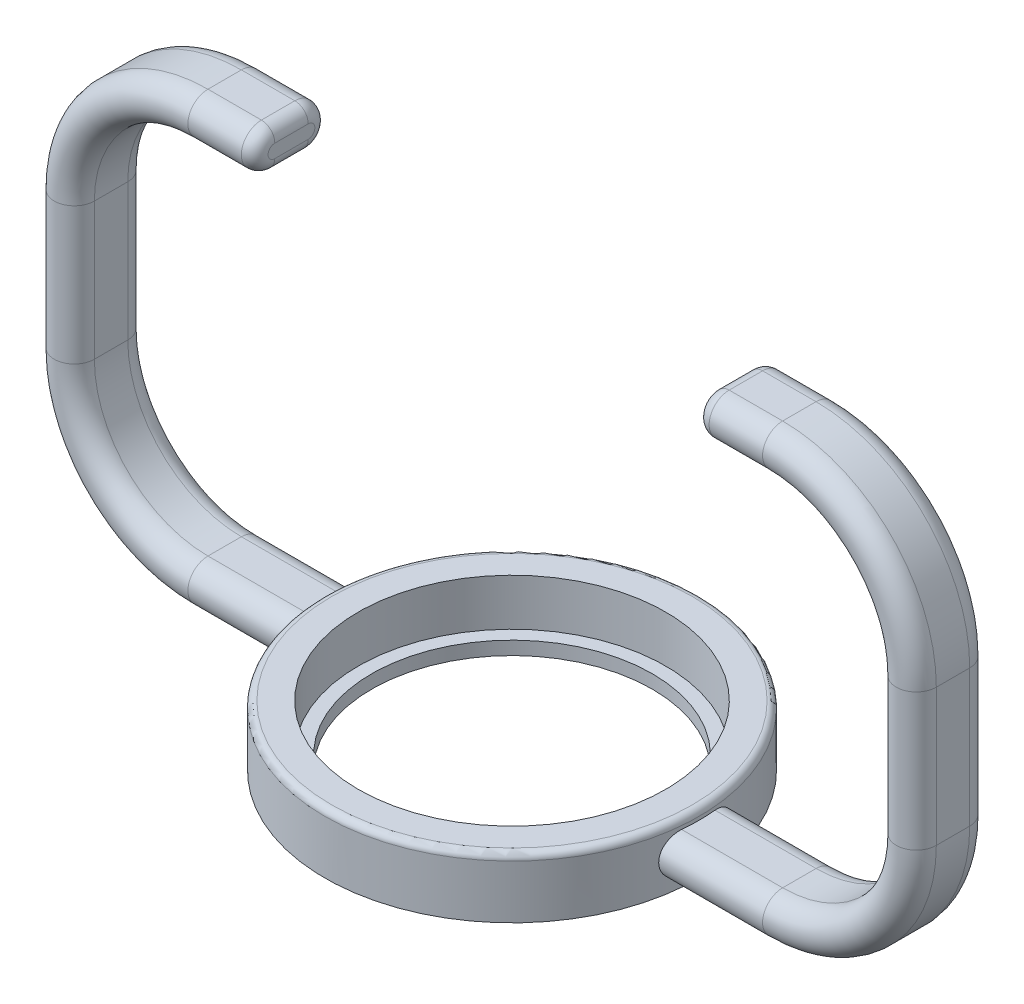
ISO-10303-21;
HEADER;
FILE_DESCRIPTION(('STEP AP214'),'2;1');
FILE_NAME('part.step','',(''),(''),'','','');
FILE_SCHEMA(('AUTOMOTIVE_DESIGN { 1 0 10303 214 1 1 1 1 }'));
ENDSEC;
DATA;
#1=APPLICATION_CONTEXT('core data for automotive mechanical design processes');
#2=APPLICATION_PROTOCOL_DEFINITION('international standard','automotive_design',2000,#1);
#3=PRODUCT_CONTEXT('',#1,'mechanical');
#4=PRODUCT('Part','Part','',(#3));
#5=PRODUCT_RELATED_PRODUCT_CATEGORY('part','',(#4));
#6=PRODUCT_DEFINITION_FORMATION('','',#4);
#7=PRODUCT_DEFINITION_CONTEXT('part definition',#1,'design');
#8=PRODUCT_DEFINITION('design','',#6,#7);
#9=PRODUCT_DEFINITION_SHAPE('','',#8);
#10=(LENGTH_UNIT() NAMED_UNIT(*) SI_UNIT(.MILLI.,.METRE.));
#11=(NAMED_UNIT(*) PLANE_ANGLE_UNIT() SI_UNIT($,.RADIAN.));
#12=(NAMED_UNIT(*) SI_UNIT($,.STERADIAN.) SOLID_ANGLE_UNIT());
#13=UNCERTAINTY_MEASURE_WITH_UNIT(LENGTH_MEASURE(1.E-05),#10,'distance_accuracy_value','');
#14=(GEOMETRIC_REPRESENTATION_CONTEXT(3) GLOBAL_UNCERTAINTY_ASSIGNED_CONTEXT((#13)) GLOBAL_UNIT_ASSIGNED_CONTEXT((#10,
#11,#12)) REPRESENTATION_CONTEXT('',''));
#15=CARTESIAN_POINT('',(0.,0.,0.));
#16=DIRECTION('',(0.,0.,1.));
#17=DIRECTION('',(1.,0.,0.));
#18=AXIS2_PLACEMENT_3D('',#15,#16,#17);
#19=CARTESIAN_POINT('',(0.,7.,0.));
#20=DIRECTION('',(0.,1.,0.));
#21=DIRECTION('',(0.,0.,1.));
#22=AXIS2_PLACEMENT_3D('',#19,#20,#21);
#23=PLANE('',#22);
#24=CARTESIAN_POINT('',(0.,7.,0.));
#25=DIRECTION('',(0.,1.,0.));
#26=DIRECTION('',(0.,0.,1.));
#27=AXIS2_PLACEMENT_3D('',#24,#25,#26);
#28=CIRCLE('',#27,27.);
#29=CARTESIAN_POINT('',(0.,7.,27.));
#30=VERTEX_POINT('',#29);
#31=EDGE_CURVE('E502',#30,#30,#28,.T.);
#32=ORIENTED_EDGE('',*,*,#31,.T.);
#33=EDGE_LOOP('',(#32));
#34=FACE_BOUND('',#33,.T.);
#35=CARTESIAN_POINT('',(0.,7.,0.));
#36=DIRECTION('',(0.,1.,0.));
#37=DIRECTION('',(0.,0.,1.));
#38=AXIS2_PLACEMENT_3D('',#35,#36,#37);
#39=CIRCLE('',#38,23.);
#40=CARTESIAN_POINT('',(0.,7.,23.));
#41=VERTEX_POINT('',#40);
#42=EDGE_CURVE('E499',#41,#41,#39,.T.);
#43=ORIENTED_EDGE('',*,*,#42,.F.);
#44=EDGE_LOOP('',(#43));
#45=FACE_BOUND('',#44,.T.);
#46=ADVANCED_FACE('F36',(#34,#45),#23,.T.);
#47=CARTESIAN_POINT('',(0.,7.,0.));
#48=DIRECTION('',(0.,-1.,0.));
#49=DIRECTION('',(0.,0.,-1.));
#50=AXIS2_PLACEMENT_3D('',#47,#48,#49);
#51=CYLINDRICAL_SURFACE('',#50,28.);
#52=CARTESIAN_POINT('',(0.,5.50000000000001,0.));
#53=DIRECTION('',(0.,1.,0.));
#54=DIRECTION('',(-1.,0.,0.));
#55=AXIS2_PLACEMENT_3D('',#52,#53,#54);
#56=CIRCLE('',#55,28.);
#57=CARTESIAN_POINT('',(27.8881695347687,5.50000000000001,2.5));
#58=VERTEX_POINT('',#57);
#59=CARTESIAN_POINT('',(27.8881695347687,5.50000000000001,-2.5));
#60=VERTEX_POINT('',#59);
#61=EDGE_CURVE('E606',#58,#60,#56,.T.);
#62=ORIENTED_EDGE('',*,*,#61,.T.);
#63=CARTESIAN_POINT('',(27.8881695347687,-0.5,-2.5));
#64=CARTESIAN_POINT('',(27.9031812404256,-0.499993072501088,-2.33251829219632));
#65=CARTESIAN_POINT('',(27.9166816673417,-0.485929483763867,-2.16479725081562));
#66=CARTESIAN_POINT('',(27.9403845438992,-0.429899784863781,-1.83372177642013));
#67=CARTESIAN_POINT('',(27.9505837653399,-0.387906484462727,-1.67037176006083));
#68=CARTESIAN_POINT('',(27.9677488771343,-0.27711616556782,-1.35288385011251));
#69=CARTESIAN_POINT('',(27.9747156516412,-0.208326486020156,-1.1987434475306));
#70=CARTESIAN_POINT('',(27.9857881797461,-0.0458687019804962,-0.904114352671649));
#71=CARTESIAN_POINT('',(27.9898944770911,0.0477946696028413,-0.763623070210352));
#72=CARTESIAN_POINT('',(27.9958362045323,0.257199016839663,-0.50048135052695));
#73=CARTESIAN_POINT('',(27.9976750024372,0.372906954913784,-0.377804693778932));
#74=CARTESIAN_POINT('',(27.999804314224,0.623222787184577,-0.153524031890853));
#75=CARTESIAN_POINT('',(28.0000947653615,0.757831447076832,-0.051920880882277));
#76=CARTESIAN_POINT('',(27.9998541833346,1.04246342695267,0.127537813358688));
#77=CARTESIAN_POINT('',(27.9993213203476,1.19252038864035,0.205339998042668));
#78=CARTESIAN_POINT('',(27.9980747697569,1.50355245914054,0.334688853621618));
#79=CARTESIAN_POINT('',(27.997361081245,1.6645276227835,0.386235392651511));
#80=CARTESIAN_POINT('',(27.9962194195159,1.99308342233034,0.461669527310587));
#81=CARTESIAN_POINT('',(27.9957918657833,2.16067337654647,0.48551655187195));
#82=CARTESIAN_POINT('',(27.9954520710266,2.49747838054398,0.504737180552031));
#83=CARTESIAN_POINT('',(27.9955398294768,2.66669342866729,0.500110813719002));
#84=CARTESIAN_POINT('',(27.9961858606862,3.00193022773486,0.46251800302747));
#85=CARTESIAN_POINT('',(27.9967440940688,3.16795224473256,0.42955393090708));
#86=CARTESIAN_POINT('',(27.9980197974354,3.49210733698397,0.336224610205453));
#87=CARTESIAN_POINT('',(27.9987372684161,3.65024036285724,0.275859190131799));
#88=CARTESIAN_POINT('',(27.9997961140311,3.95415074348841,0.129429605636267));
#89=CARTESIAN_POINT('',(28.0001374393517,4.0999264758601,0.0433620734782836));
#90=CARTESIAN_POINT('',(27.9997571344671,4.37495869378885,-0.152025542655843));
#91=CARTESIAN_POINT('',(27.9990355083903,4.50421524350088,-0.261345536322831));
#92=CARTESIAN_POINT('',(27.9957882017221,4.74245426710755,-0.500046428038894));
#93=CARTESIAN_POINT('',(27.9932636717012,4.85144961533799,-0.629414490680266));
#94=CARTESIAN_POINT('',(27.9857229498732,5.04616408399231,-0.90455318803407));
#95=CARTESIAN_POINT('',(27.9807068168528,5.13188375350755,-1.05032343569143));
#96=CARTESIAN_POINT('',(27.967668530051,5.27744808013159,-1.35369326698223));
#97=CARTESIAN_POINT('',(27.959653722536,5.33735520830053,-1.51126319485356));
#98=CARTESIAN_POINT('',(27.9403386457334,5.42995607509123,-1.83401007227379));
#99=CARTESIAN_POINT('',(27.9290384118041,5.46265010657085,-1.99918693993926));
#100=CARTESIAN_POINT('',(27.9031865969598,5.50000238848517,-2.3324005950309));
#101=CARTESIAN_POINT('',(27.8886354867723,5.50466469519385,-2.5004369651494));
#102=CARTESIAN_POINT('',(27.8566486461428,5.4859703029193,-2.83466349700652));
#103=CARTESIAN_POINT('',(27.8392128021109,5.46261250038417,-3.0008535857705));
#104=CARTESIAN_POINT('',(27.8020192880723,5.38840273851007,-3.32791350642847));
#105=CARTESIAN_POINT('',(27.7822465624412,5.33736394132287,-3.48873920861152));
#106=CARTESIAN_POINT('',(27.7414613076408,5.20917904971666,-3.79946114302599));
#107=CARTESIAN_POINT('',(27.7204486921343,5.13203113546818,-3.94935661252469));
#108=CARTESIAN_POINT('',(27.6781795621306,4.95291205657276,-4.23550685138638));
#109=CARTESIAN_POINT('',(27.6569226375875,4.85071045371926,-4.37161738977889));
#110=CARTESIAN_POINT('',(27.6157236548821,4.62467465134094,-4.62474697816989));
#111=CARTESIAN_POINT('',(27.5957816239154,4.50084000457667,-4.74176563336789));
#112=CARTESIAN_POINT('',(27.5585843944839,4.23487656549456,-4.9533831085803));
#113=CARTESIAN_POINT('',(27.5413299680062,4.09274253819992,-5.04797549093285));
#114=CARTESIAN_POINT('',(27.5107912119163,3.79417093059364,-5.21184680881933));
#115=CARTESIAN_POINT('',(27.4975065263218,3.63773463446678,-5.28112801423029));
#116=CARTESIAN_POINT('',(27.4760931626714,3.31730367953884,-5.39142262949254));
#117=CARTESIAN_POINT('',(27.4678953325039,3.15344443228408,-5.43281585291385));
#118=CARTESIAN_POINT('',(27.4570158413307,2.82093121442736,-5.4875381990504));
#119=CARTESIAN_POINT('',(27.4543335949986,2.65227775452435,-5.50087029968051));
#120=CARTESIAN_POINT('',(27.4546969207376,2.31777329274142,-5.49905551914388));
#121=CARTESIAN_POINT('',(27.4576537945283,2.15191961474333,-5.4843496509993));
#122=CARTESIAN_POINT('',(27.4688880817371,1.82509786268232,-5.42779943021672));
#123=CARTESIAN_POINT('',(27.4771654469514,1.66412974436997,-5.38595532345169));
#124=CARTESIAN_POINT('',(27.4984025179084,1.35164625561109,-5.27645186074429));
#125=CARTESIAN_POINT('',(27.5113602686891,1.20012696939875,-5.20880328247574));
#126=CARTESIAN_POINT('',(27.5410064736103,0.910560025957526,-5.04970129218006));
#127=CARTESIAN_POINT('',(27.5576951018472,0.772512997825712,-4.95824676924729));
#128=CARTESIAN_POINT('',(27.5939112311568,0.511570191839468,-4.7525884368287));
#129=CARTESIAN_POINT('',(27.6134774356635,0.388931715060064,-4.63806503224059));
#130=CARTESIAN_POINT('',(27.6539486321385,0.164477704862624,-4.39031332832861));
#131=CARTESIAN_POINT('',(27.6748540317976,0.0626685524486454,-4.25707931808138));
#132=CARTESIAN_POINT('',(27.7170107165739,-0.118734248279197,-3.97343243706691));
#133=CARTESIAN_POINT('',(27.7382624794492,-0.197971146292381,-3.8227915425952));
#134=CARTESIAN_POINT('',(27.77953961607,-0.329855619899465,-3.51026039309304));
#135=CARTESIAN_POINT('',(27.7995662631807,-0.382531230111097,-3.34838220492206));
#136=CARTESIAN_POINT('',(27.8312597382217,-0.447315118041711,-3.07143303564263));
#137=CARTESIAN_POINT('',(27.8435357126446,-0.467033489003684,-2.95815354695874));
#138=CARTESIAN_POINT('',(27.8668352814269,-0.493378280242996,-2.72995366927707));
#139=CARTESIAN_POINT('',(27.8778588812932,-0.500004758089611,-2.61503328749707));
#140=CARTESIAN_POINT('',(27.8881695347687,-0.5,-2.5));
#141=B_SPLINE_CURVE_WITH_KNOTS('',3,(#63,#64,#65,#66,#67,#68,#69,#70,#71,#72,#73,#74,#75,#76,
#77,#78,#79,#80,#81,#82,#83,#84,#85,#86,#87,#88,#89,#90,#91,#92,#93,#94,#95,#96,#97,#98,#99,
#100,#101,#102,#103,#104,#105,#106,#107,#108,#109,#110,#111,#112,#113,#114,#115,#116,#117,#118,
#119,#120,#121,#122,#123,#124,#125,#126,#127,#128,#129,#130,#131,#132,#133,#134,#135,#136,#137,
#138,#139,#140),.UNSPECIFIED.,.T.,.F.,(4,2,2,2,2,2,2,2,2,2,2,2,2,2,2,2,2,2,2,2,2,2,2,2,2,2,2,2,
2,2,2,2,2,2,2,2,2,2,4),(0.,0.504042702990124,1.00857682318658,1.51297285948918,2.01727298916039,
2.52082320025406,3.02439381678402,3.52908523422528,4.03377918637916,4.53921142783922,
5.04464315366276,5.55003258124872,6.05542517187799,6.56088401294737,7.06634089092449,
7.57147548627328,8.07659816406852,8.58049139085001,9.0843791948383,9.58819408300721,
10.0920288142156,10.5993073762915,11.1066213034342,11.618789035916,12.1309673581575,
12.6432925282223,13.1555717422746,13.6607248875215,14.1658244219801,14.6630446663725,
15.1602604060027,15.6572687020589,16.154300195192,16.6587606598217,17.1633754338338,
17.6755716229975,18.1872260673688,18.533424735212,18.8796218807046),.UNSPECIFIED.);
#142=CARTESIAN_POINT('',(27.8881695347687,-0.499999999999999,-2.5));
#143=VERTEX_POINT('',#142);
#144=EDGE_CURVE('E11',#60,#143,#141,.T.);
#145=ORIENTED_EDGE('',*,*,#144,.T.);
#146=CARTESIAN_POINT('',(0.,-0.499999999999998,0.));
#147=DIRECTION('',(0.,-1.,0.));
#148=DIRECTION('',(1.,0.,0.));
#149=AXIS2_PLACEMENT_3D('',#146,#147,#148);
#150=CIRCLE('',#149,28.);
#151=CARTESIAN_POINT('',(27.8881695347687,-0.5,2.5));
#152=VERTEX_POINT('',#151);
#153=EDGE_CURVE('E47',#143,#152,#150,.T.);
#154=ORIENTED_EDGE('',*,*,#153,.T.);
#155=CARTESIAN_POINT('',(27.8881695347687,-0.5,2.5));
#156=CARTESIAN_POINT('',(27.8729727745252,-0.49999257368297,2.66949947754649));
#157=CARTESIAN_POINT('',(27.8562080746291,-0.485586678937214,2.83897549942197));
#158=CARTESIAN_POINT('',(27.8201493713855,-0.428465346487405,3.17294779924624));
#159=CARTESIAN_POINT('',(27.8008523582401,-0.385715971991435,3.33743786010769));
#160=CARTESIAN_POINT('',(27.760678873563,-0.273250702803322,3.65657723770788));
#161=CARTESIAN_POINT('',(27.7398036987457,-0.203556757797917,3.81123444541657));
#162=CARTESIAN_POINT('',(27.6976271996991,-0.0392053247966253,4.10654651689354));
#163=CARTESIAN_POINT('',(27.6763259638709,0.0554470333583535,4.24720424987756));
#164=CARTESIAN_POINT('',(27.63449168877,0.267720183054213,4.51141729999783));
#165=CARTESIAN_POINT('',(27.6139635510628,0.385465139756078,4.63487370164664));
#166=CARTESIAN_POINT('',(27.5751915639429,0.6403726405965,4.8602386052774));
#167=CARTESIAN_POINT('',(27.5569477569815,0.777535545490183,4.9621467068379));
#168=CARTESIAN_POINT('',(27.5241524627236,1.06675726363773,5.14094185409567));
#169=CARTESIAN_POINT('',(27.509583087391,1.21873871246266,5.21795065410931));
#170=CARTESIAN_POINT('',(27.4851332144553,1.53385971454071,5.34524862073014));
#171=CARTESIAN_POINT('',(27.4752521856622,1.69699800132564,5.39554081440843));
#172=CARTESIAN_POINT('',(27.4610853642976,2.02689401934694,5.46718520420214));
#173=CARTESIAN_POINT('',(27.4567091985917,2.19354634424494,5.4890050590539));
#174=CARTESIAN_POINT('',(27.4535992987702,2.52820150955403,5.50453944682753));
#175=CARTESIAN_POINT('',(27.4548650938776,2.69620423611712,5.49825632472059));
#176=CARTESIAN_POINT('',(27.4628890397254,3.0267191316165,5.45803325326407));
#177=CARTESIAN_POINT('',(27.4695827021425,3.18927255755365,5.42441802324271));
#178=CARTESIAN_POINT('',(27.4878652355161,3.50637399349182,5.33099532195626));
#179=CARTESIAN_POINT('',(27.4994542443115,3.66092177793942,5.27118711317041));
#180=CARTESIAN_POINT('',(27.5267495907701,3.95869313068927,5.12674014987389));
#181=CARTESIAN_POINT('',(27.5424802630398,4.10184303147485,5.04195427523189));
#182=CARTESIAN_POINT('',(27.5769031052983,4.37197185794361,4.85014242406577));
#183=CARTESIAN_POINT('',(27.5955955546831,4.49894925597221,4.74311434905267));
#184=CARTESIAN_POINT('',(27.6350200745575,4.73541968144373,4.50778291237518));
#185=CARTESIAN_POINT('',(27.6557814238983,4.84457866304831,4.37914870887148));
#186=CARTESIAN_POINT('',(27.697728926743,5.03982264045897,4.1054780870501));
#187=CARTESIAN_POINT('',(27.7189151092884,5.12590605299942,3.96044054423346));
#188=CARTESIAN_POINT('',(27.7606789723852,5.27341837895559,3.65629382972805));
#189=CARTESIAN_POINT('',(27.78124778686,5.33457539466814,3.49705142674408));
#190=CARTESIAN_POINT('',(27.8204299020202,5.4291016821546,3.17028973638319));
#191=CARTESIAN_POINT('',(27.8390432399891,5.46247148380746,3.00277060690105));
#192=CARTESIAN_POINT('',(27.8734167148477,5.5002709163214,2.66483966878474));
#193=CARTESIAN_POINT('',(27.8891871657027,5.50480729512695,2.49444087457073));
#194=CARTESIAN_POINT('',(27.917462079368,5.48494674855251,2.15506447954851));
#195=CARTESIAN_POINT('',(27.9299667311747,5.46055149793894,1.98608679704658));
#196=CARTESIAN_POINT('',(27.9514628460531,5.38380134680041,1.65614201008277));
#197=CARTESIAN_POINT('',(27.9604877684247,5.33172480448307,1.49511229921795));
#198=CARTESIAN_POINT('',(27.9753911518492,5.20120505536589,1.18396392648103));
#199=CARTESIAN_POINT('',(27.9812696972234,5.12276255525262,1.03384497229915));
#200=CARTESIAN_POINT('',(27.9903255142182,4.94216690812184,0.749558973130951));
#201=CARTESIAN_POINT('',(27.9935157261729,4.8401303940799,0.615318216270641));
#202=CARTESIAN_POINT('',(27.9978894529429,4.61502361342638,0.365776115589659));
#203=CARTESIAN_POINT('',(27.9990729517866,4.49195317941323,0.250474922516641));
#204=CARTESIAN_POINT('',(28.0001636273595,4.22807119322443,0.0419334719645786));
#205=CARTESIAN_POINT('',(28.0000689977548,4.08723481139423,-0.0512753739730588));
#206=CARTESIAN_POINT('',(27.9993084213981,3.79194077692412,-0.212786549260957));
#207=CARTESIAN_POINT('',(27.9986424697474,3.63748300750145,-0.281088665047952));
#208=CARTESIAN_POINT('',(27.9973246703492,3.31897799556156,-0.390970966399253));
#209=CARTESIAN_POINT('',(27.9966728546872,3.15491154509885,-0.432495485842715));
#210=CARTESIAN_POINT('',(27.9957709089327,2.8221352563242,-0.487418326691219));
#211=CARTESIAN_POINT('',(27.9955207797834,2.65342540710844,-0.500816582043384));
#212=CARTESIAN_POINT('',(27.9955513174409,2.31611788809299,-0.49910611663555));
#213=CARTESIAN_POINT('',(27.9958320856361,2.14752024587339,-0.483991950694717));
#214=CARTESIAN_POINT('',(27.9967790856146,1.81525529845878,-0.425675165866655));
#215=CARTESIAN_POINT('',(27.9974453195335,1.65158802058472,-0.382472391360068));
#216=CARTESIAN_POINT('',(27.9987627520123,1.33382556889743,-0.269203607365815));
#217=CARTESIAN_POINT('',(27.9994139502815,1.17973057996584,-0.199137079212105));
#218=CARTESIAN_POINT('',(28.000100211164,0.885493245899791,-0.0341304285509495));
#219=CARTESIAN_POINT('',(28.0001352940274,0.745350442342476,0.0608088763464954));
#220=CARTESIAN_POINT('',(27.998870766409,0.483025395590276,0.272838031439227));
#221=CARTESIAN_POINT('',(27.9975714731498,0.36083889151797,0.389922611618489));
#222=CARTESIAN_POINT('',(27.9929025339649,0.137841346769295,0.642947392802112));
#223=CARTESIAN_POINT('',(27.9895324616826,0.0370347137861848,0.77889147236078));
#224=CARTESIAN_POINT('',(27.9800877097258,-0.140157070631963,1.06545609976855));
#225=CARTESIAN_POINT('',(27.9740173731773,-0.216581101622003,1.21605277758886));
#226=CARTESIAN_POINT('',(27.9587280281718,-0.34302271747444,1.52766588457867));
#227=CARTESIAN_POINT('',(27.9495125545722,-0.393069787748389,1.68867045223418));
#228=CARTESIAN_POINT('',(27.9316016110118,-0.452801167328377,1.95883970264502));
#229=CARTESIAN_POINT('',(27.9238586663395,-0.47048668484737,2.06636743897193));
#230=CARTESIAN_POINT('',(27.9070152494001,-0.494088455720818,2.28260000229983));
#231=CARTESIAN_POINT('',(27.8979147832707,-0.500004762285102,2.39130482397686));
#232=CARTESIAN_POINT('',(27.8881695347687,-0.5,2.5));
#233=B_SPLINE_CURVE_WITH_KNOTS('',3,(#155,#156,#157,#158,#159,#160,#161,#162,#163,#164,#165,
#166,#167,#168,#169,#170,#171,#172,#173,#174,#175,#176,#177,#178,#179,#180,#181,#182,#183,#184,
#185,#186,#187,#188,#189,#190,#191,#192,#193,#194,#195,#196,#197,#198,#199,#200,#201,#202,#203,
#204,#205,#206,#207,#208,#209,#210,#211,#212,#213,#214,#215,#216,#217,#218,#219,#220,#221,#222,
#223,#224,#225,#226,#227,#228,#229,#230,#231,#232),.UNSPECIFIED.,.T.,.F.,(4,2,2,2,2,2,2,2,2,2,2,
2,2,2,2,2,2,2,2,2,2,2,2,2,2,2,2,2,2,2,2,2,2,2,2,2,2,2,4),(0.,0.510136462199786,1.02088483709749,
1.53121801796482,2.04144638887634,2.55449735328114,3.06755785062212,3.57807021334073,
4.08852472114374,4.59048484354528,5.09240308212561,5.58844392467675,6.08449873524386,
6.5835358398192,7.08262004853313,7.59019132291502,8.09779741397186,8.61080114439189,
9.12379509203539,9.63488870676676,10.1459527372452,10.6519722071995,11.1579781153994,
11.6615342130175,12.1650943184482,12.6693661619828,13.173642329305,13.678963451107,
14.1842857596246,14.6897045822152,15.1951262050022,15.7005575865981,16.2059723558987,
16.7112670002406,17.2166657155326,17.721254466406,18.2252779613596,18.5524153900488,
18.8795513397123),.UNSPECIFIED.);
#234=EDGE_CURVE('E229',#152,#58,#233,.T.);
#235=ORIENTED_EDGE('',*,*,#234,.T.);
#236=EDGE_LOOP('',(#62,#145,#154,#235));
#237=FACE_BOUND('',#236,.T.);
#238=CARTESIAN_POINT('',(0.,-0.499999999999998,0.));
#239=DIRECTION('',(0.,-1.,0.));
#240=DIRECTION('',(1.,0.,0.));
#241=AXIS2_PLACEMENT_3D('',#238,#239,#240);
#242=CIRCLE('',#241,28.);
#243=CARTESIAN_POINT('',(-27.8881695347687,-0.5,2.5));
#244=VERTEX_POINT('',#243);
#245=CARTESIAN_POINT('',(-27.8881695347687,-0.499999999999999,-2.5));
#246=VERTEX_POINT('',#245);
#247=EDGE_CURVE('E601',#244,#246,#242,.T.);
#248=ORIENTED_EDGE('',*,*,#247,.T.);
#249=CARTESIAN_POINT('',(-27.8881695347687,-0.5,-2.5));
#250=CARTESIAN_POINT('',(-27.8729727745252,-0.49999257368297,-2.66949947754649));
#251=CARTESIAN_POINT('',(-27.8562080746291,-0.485586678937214,-2.83897549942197));
#252=CARTESIAN_POINT('',(-27.8201493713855,-0.428465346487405,-3.17294779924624));
#253=CARTESIAN_POINT('',(-27.8008523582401,-0.385715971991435,-3.33743786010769));
#254=CARTESIAN_POINT('',(-27.760678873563,-0.273250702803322,-3.65657723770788));
#255=CARTESIAN_POINT('',(-27.7398036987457,-0.203556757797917,-3.81123444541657));
#256=CARTESIAN_POINT('',(-27.6976271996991,-0.0392053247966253,-4.10654651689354));
#257=CARTESIAN_POINT('',(-27.6763259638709,0.0554470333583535,-4.24720424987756));
#258=CARTESIAN_POINT('',(-27.63449168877,0.267720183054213,-4.51141729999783));
#259=CARTESIAN_POINT('',(-27.6139635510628,0.385465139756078,-4.63487370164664));
#260=CARTESIAN_POINT('',(-27.5751915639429,0.6403726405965,-4.8602386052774));
#261=CARTESIAN_POINT('',(-27.5569477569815,0.777535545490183,-4.9621467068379));
#262=CARTESIAN_POINT('',(-27.5241524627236,1.06675726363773,-5.14094185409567));
#263=CARTESIAN_POINT('',(-27.509583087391,1.21873871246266,-5.21795065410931));
#264=CARTESIAN_POINT('',(-27.4851332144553,1.53385971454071,-5.34524862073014));
#265=CARTESIAN_POINT('',(-27.4752521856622,1.69699800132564,-5.39554081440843));
#266=CARTESIAN_POINT('',(-27.4610853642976,2.02689401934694,-5.46718520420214));
#267=CARTESIAN_POINT('',(-27.4567091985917,2.19354634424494,-5.4890050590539));
#268=CARTESIAN_POINT('',(-27.4535992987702,2.52820150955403,-5.50453944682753));
#269=CARTESIAN_POINT('',(-27.4548650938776,2.69620423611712,-5.49825632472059));
#270=CARTESIAN_POINT('',(-27.4628890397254,3.0267191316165,-5.45803325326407));
#271=CARTESIAN_POINT('',(-27.4695827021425,3.18927255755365,-5.42441802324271));
#272=CARTESIAN_POINT('',(-27.4878652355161,3.50637399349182,-5.33099532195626));
#273=CARTESIAN_POINT('',(-27.4994542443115,3.66092177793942,-5.27118711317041));
#274=CARTESIAN_POINT('',(-27.5267495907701,3.95869313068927,-5.12674014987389));
#275=CARTESIAN_POINT('',(-27.5424802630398,4.10184303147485,-5.04195427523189));
#276=CARTESIAN_POINT('',(-27.5769031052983,4.37197185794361,-4.85014242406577));
#277=CARTESIAN_POINT('',(-27.5955955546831,4.49894925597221,-4.74311434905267));
#278=CARTESIAN_POINT('',(-27.6350200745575,4.73541968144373,-4.50778291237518));
#279=CARTESIAN_POINT('',(-27.6557814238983,4.84457866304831,-4.37914870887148));
#280=CARTESIAN_POINT('',(-27.697728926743,5.03982264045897,-4.1054780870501));
#281=CARTESIAN_POINT('',(-27.7189151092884,5.12590605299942,-3.96044054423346));
#282=CARTESIAN_POINT('',(-27.7606789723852,5.27341837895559,-3.65629382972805));
#283=CARTESIAN_POINT('',(-27.78124778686,5.33457539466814,-3.49705142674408));
#284=CARTESIAN_POINT('',(-27.8204299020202,5.4291016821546,-3.17028973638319));
#285=CARTESIAN_POINT('',(-27.8390432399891,5.46247148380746,-3.00277060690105));
#286=CARTESIAN_POINT('',(-27.8734167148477,5.5002709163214,-2.66483966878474));
#287=CARTESIAN_POINT('',(-27.8891871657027,5.50480729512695,-2.49444087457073));
#288=CARTESIAN_POINT('',(-27.917462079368,5.48494674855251,-2.15506447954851));
#289=CARTESIAN_POINT('',(-27.9299667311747,5.46055149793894,-1.98608679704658));
#290=CARTESIAN_POINT('',(-27.9514628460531,5.38380134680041,-1.65614201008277));
#291=CARTESIAN_POINT('',(-27.9604877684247,5.33172480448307,-1.49511229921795));
#292=CARTESIAN_POINT('',(-27.9753911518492,5.20120505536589,-1.18396392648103));
#293=CARTESIAN_POINT('',(-27.9812696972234,5.12276255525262,-1.03384497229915));
#294=CARTESIAN_POINT('',(-27.9903255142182,4.94216690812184,-0.749558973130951));
#295=CARTESIAN_POINT('',(-27.9935157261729,4.8401303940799,-0.615318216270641));
#296=CARTESIAN_POINT('',(-27.9978894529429,4.61502361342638,-0.365776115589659));
#297=CARTESIAN_POINT('',(-27.9990729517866,4.49195317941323,-0.250474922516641));
#298=CARTESIAN_POINT('',(-28.0001636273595,4.22807119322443,-0.0419334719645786));
#299=CARTESIAN_POINT('',(-28.0000689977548,4.08723481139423,0.0512753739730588));
#300=CARTESIAN_POINT('',(-27.9993084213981,3.79194077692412,0.212786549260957));
#301=CARTESIAN_POINT('',(-27.9986424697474,3.63748300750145,0.281088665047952));
#302=CARTESIAN_POINT('',(-27.9973246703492,3.31897799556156,0.390970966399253));
#303=CARTESIAN_POINT('',(-27.9966728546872,3.15491154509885,0.432495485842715));
#304=CARTESIAN_POINT('',(-27.9957709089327,2.8221352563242,0.487418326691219));
#305=CARTESIAN_POINT('',(-27.9955207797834,2.65342540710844,0.500816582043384));
#306=CARTESIAN_POINT('',(-27.9955513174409,2.31611788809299,0.49910611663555));
#307=CARTESIAN_POINT('',(-27.9958320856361,2.14752024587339,0.483991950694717));
#308=CARTESIAN_POINT('',(-27.9967790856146,1.81525529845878,0.425675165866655));
#309=CARTESIAN_POINT('',(-27.9974453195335,1.65158802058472,0.382472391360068));
#310=CARTESIAN_POINT('',(-27.9987627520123,1.33382556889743,0.269203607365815));
#311=CARTESIAN_POINT('',(-27.9994139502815,1.17973057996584,0.199137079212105));
#312=CARTESIAN_POINT('',(-28.000100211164,0.885493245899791,0.0341304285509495));
#313=CARTESIAN_POINT('',(-28.0001352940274,0.745350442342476,-0.0608088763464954));
#314=CARTESIAN_POINT('',(-27.998870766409,0.483025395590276,-0.272838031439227));
#315=CARTESIAN_POINT('',(-27.9975714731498,0.36083889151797,-0.389922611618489));
#316=CARTESIAN_POINT('',(-27.9929025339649,0.137841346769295,-0.642947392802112));
#317=CARTESIAN_POINT('',(-27.9895324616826,0.0370347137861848,-0.77889147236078));
#318=CARTESIAN_POINT('',(-27.9800877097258,-0.140157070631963,-1.06545609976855));
#319=CARTESIAN_POINT('',(-27.9740173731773,-0.216581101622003,-1.21605277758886));
#320=CARTESIAN_POINT('',(-27.9587280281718,-0.34302271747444,-1.52766588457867));
#321=CARTESIAN_POINT('',(-27.9495125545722,-0.393069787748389,-1.68867045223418));
#322=CARTESIAN_POINT('',(-27.9316016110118,-0.452801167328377,-1.95883970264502));
#323=CARTESIAN_POINT('',(-27.9238586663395,-0.47048668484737,-2.06636743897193));
#324=CARTESIAN_POINT('',(-27.9070152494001,-0.494088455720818,-2.28260000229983));
#325=CARTESIAN_POINT('',(-27.8979147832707,-0.500004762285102,-2.39130482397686));
#326=CARTESIAN_POINT('',(-27.8881695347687,-0.5,-2.5));
#327=B_SPLINE_CURVE_WITH_KNOTS('',3,(#249,#250,#251,#252,#253,#254,#255,#256,#257,#258,#259,
#260,#261,#262,#263,#264,#265,#266,#267,#268,#269,#270,#271,#272,#273,#274,#275,#276,#277,#278,
#279,#280,#281,#282,#283,#284,#285,#286,#287,#288,#289,#290,#291,#292,#293,#294,#295,#296,#297,
#298,#299,#300,#301,#302,#303,#304,#305,#306,#307,#308,#309,#310,#311,#312,#313,#314,#315,#316,
#317,#318,#319,#320,#321,#322,#323,#324,#325,#326),.UNSPECIFIED.,.T.,.F.,(4,2,2,2,2,2,2,2,2,2,2,
2,2,2,2,2,2,2,2,2,2,2,2,2,2,2,2,2,2,2,2,2,2,2,2,2,2,2,4),(0.,0.510136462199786,1.02088483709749,
1.53121801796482,2.04144638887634,2.55449735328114,3.06755785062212,3.57807021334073,
4.08852472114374,4.59048484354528,5.09240308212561,5.58844392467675,6.08449873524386,
6.5835358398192,7.08262004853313,7.59019132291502,8.09779741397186,8.61080114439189,
9.12379509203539,9.63488870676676,10.1459527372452,10.6519722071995,11.1579781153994,
11.6615342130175,12.1650943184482,12.6693661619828,13.173642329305,13.678963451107,
14.1842857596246,14.6897045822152,15.1951262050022,15.7005575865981,16.2059723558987,
16.7112670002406,17.2166657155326,17.721254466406,18.2252779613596,18.5524153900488,
18.8795513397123),.UNSPECIFIED.);
#328=CARTESIAN_POINT('',(-27.8881695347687,5.50000000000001,-2.5));
#329=VERTEX_POINT('',#328);
#330=EDGE_CURVE('E596',#246,#329,#327,.T.);
#331=ORIENTED_EDGE('',*,*,#330,.T.);
#332=CARTESIAN_POINT('',(0.,5.50000000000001,0.));
#333=DIRECTION('',(0.,1.,0.));
#334=DIRECTION('',(-1.,0.,0.));
#335=AXIS2_PLACEMENT_3D('',#332,#333,#334);
#336=CIRCLE('',#335,28.);
#337=CARTESIAN_POINT('',(-27.8881695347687,5.50000000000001,2.5));
#338=VERTEX_POINT('',#337);
#339=EDGE_CURVE('E516',#329,#338,#336,.T.);
#340=ORIENTED_EDGE('',*,*,#339,.T.);
#341=CARTESIAN_POINT('',(-27.8881695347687,-0.5,2.5));
#342=CARTESIAN_POINT('',(-27.9031812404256,-0.499993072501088,2.33251829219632));
#343=CARTESIAN_POINT('',(-27.9166816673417,-0.485929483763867,2.16479725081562));
#344=CARTESIAN_POINT('',(-27.9403845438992,-0.429899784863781,1.83372177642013));
#345=CARTESIAN_POINT('',(-27.9505837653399,-0.387906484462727,1.67037176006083));
#346=CARTESIAN_POINT('',(-27.9677488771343,-0.27711616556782,1.35288385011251));
#347=CARTESIAN_POINT('',(-27.9747156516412,-0.208326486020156,1.1987434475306));
#348=CARTESIAN_POINT('',(-27.9857881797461,-0.0458687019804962,0.904114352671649));
#349=CARTESIAN_POINT('',(-27.9898944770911,0.0477946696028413,0.763623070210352));
#350=CARTESIAN_POINT('',(-27.9958362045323,0.257199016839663,0.50048135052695));
#351=CARTESIAN_POINT('',(-27.9976750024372,0.372906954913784,0.377804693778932));
#352=CARTESIAN_POINT('',(-27.999804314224,0.623222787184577,0.153524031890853));
#353=CARTESIAN_POINT('',(-28.0000947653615,0.757831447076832,0.051920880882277));
#354=CARTESIAN_POINT('',(-27.9998541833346,1.04246342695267,-0.127537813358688));
#355=CARTESIAN_POINT('',(-27.9993213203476,1.19252038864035,-0.205339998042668));
#356=CARTESIAN_POINT('',(-27.9980747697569,1.50355245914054,-0.334688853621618));
#357=CARTESIAN_POINT('',(-27.997361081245,1.6645276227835,-0.386235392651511));
#358=CARTESIAN_POINT('',(-27.9962194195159,1.99308342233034,-0.461669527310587));
#359=CARTESIAN_POINT('',(-27.9957918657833,2.16067337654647,-0.48551655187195));
#360=CARTESIAN_POINT('',(-27.9954520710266,2.49747838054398,-0.504737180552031));
#361=CARTESIAN_POINT('',(-27.9955398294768,2.66669342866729,-0.500110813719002));
#362=CARTESIAN_POINT('',(-27.9961858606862,3.00193022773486,-0.46251800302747));
#363=CARTESIAN_POINT('',(-27.9967440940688,3.16795224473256,-0.42955393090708));
#364=CARTESIAN_POINT('',(-27.9980197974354,3.49210733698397,-0.336224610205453));
#365=CARTESIAN_POINT('',(-27.9987372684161,3.65024036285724,-0.275859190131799));
#366=CARTESIAN_POINT('',(-27.9997961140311,3.95415074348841,-0.129429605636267));
#367=CARTESIAN_POINT('',(-28.0001374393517,4.0999264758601,-0.0433620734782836));
#368=CARTESIAN_POINT('',(-27.9997571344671,4.37495869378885,0.152025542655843));
#369=CARTESIAN_POINT('',(-27.9990355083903,4.50421524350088,0.261345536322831));
#370=CARTESIAN_POINT('',(-27.9957882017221,4.74245426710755,0.500046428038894));
#371=CARTESIAN_POINT('',(-27.9932636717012,4.85144961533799,0.629414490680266));
#372=CARTESIAN_POINT('',(-27.9857229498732,5.04616408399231,0.90455318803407));
#373=CARTESIAN_POINT('',(-27.9807068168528,5.13188375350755,1.05032343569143));
#374=CARTESIAN_POINT('',(-27.967668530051,5.27744808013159,1.35369326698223));
#375=CARTESIAN_POINT('',(-27.959653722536,5.33735520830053,1.51126319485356));
#376=CARTESIAN_POINT('',(-27.9403386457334,5.42995607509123,1.83401007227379));
#377=CARTESIAN_POINT('',(-27.9290384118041,5.46265010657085,1.99918693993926));
#378=CARTESIAN_POINT('',(-27.9031865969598,5.50000238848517,2.3324005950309));
#379=CARTESIAN_POINT('',(-27.8886354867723,5.50466469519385,2.5004369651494));
#380=CARTESIAN_POINT('',(-27.8566486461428,5.4859703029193,2.83466349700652));
#381=CARTESIAN_POINT('',(-27.8392128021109,5.46261250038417,3.0008535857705));
#382=CARTESIAN_POINT('',(-27.8020192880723,5.38840273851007,3.32791350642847));
#383=CARTESIAN_POINT('',(-27.7822465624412,5.33736394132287,3.48873920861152));
#384=CARTESIAN_POINT('',(-27.7414613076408,5.20917904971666,3.79946114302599));
#385=CARTESIAN_POINT('',(-27.7204486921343,5.13203113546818,3.94935661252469));
#386=CARTESIAN_POINT('',(-27.6781795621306,4.95291205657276,4.23550685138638));
#387=CARTESIAN_POINT('',(-27.6569226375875,4.85071045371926,4.37161738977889));
#388=CARTESIAN_POINT('',(-27.6157236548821,4.62467465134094,4.62474697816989));
#389=CARTESIAN_POINT('',(-27.5957816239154,4.50084000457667,4.74176563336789));
#390=CARTESIAN_POINT('',(-27.5585843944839,4.23487656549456,4.9533831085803));
#391=CARTESIAN_POINT('',(-27.5413299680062,4.09274253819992,5.04797549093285));
#392=CARTESIAN_POINT('',(-27.5107912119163,3.79417093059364,5.21184680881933));
#393=CARTESIAN_POINT('',(-27.4975065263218,3.63773463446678,5.28112801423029));
#394=CARTESIAN_POINT('',(-27.4760931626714,3.31730367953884,5.39142262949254));
#395=CARTESIAN_POINT('',(-27.4678953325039,3.15344443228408,5.43281585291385));
#396=CARTESIAN_POINT('',(-27.4570158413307,2.82093121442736,5.4875381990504));
#397=CARTESIAN_POINT('',(-27.4543335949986,2.65227775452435,5.50087029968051));
#398=CARTESIAN_POINT('',(-27.4546969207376,2.31777329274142,5.49905551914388));
#399=CARTESIAN_POINT('',(-27.4576537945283,2.15191961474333,5.4843496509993));
#400=CARTESIAN_POINT('',(-27.4688880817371,1.82509786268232,5.42779943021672));
#401=CARTESIAN_POINT('',(-27.4771654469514,1.66412974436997,5.38595532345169));
#402=CARTESIAN_POINT('',(-27.4984025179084,1.35164625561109,5.27645186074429));
#403=CARTESIAN_POINT('',(-27.5113602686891,1.20012696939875,5.20880328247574));
#404=CARTESIAN_POINT('',(-27.5410064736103,0.910560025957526,5.04970129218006));
#405=CARTESIAN_POINT('',(-27.5576951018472,0.772512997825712,4.95824676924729));
#406=CARTESIAN_POINT('',(-27.5939112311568,0.511570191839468,4.7525884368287));
#407=CARTESIAN_POINT('',(-27.6134774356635,0.388931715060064,4.63806503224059));
#408=CARTESIAN_POINT('',(-27.6539486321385,0.164477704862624,4.39031332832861));
#409=CARTESIAN_POINT('',(-27.6748540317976,0.0626685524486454,4.25707931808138));
#410=CARTESIAN_POINT('',(-27.7170107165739,-0.118734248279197,3.97343243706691));
#411=CARTESIAN_POINT('',(-27.7382624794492,-0.197971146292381,3.8227915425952));
#412=CARTESIAN_POINT('',(-27.77953961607,-0.329855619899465,3.51026039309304));
#413=CARTESIAN_POINT('',(-27.7995662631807,-0.382531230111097,3.34838220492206));
#414=CARTESIAN_POINT('',(-27.8312597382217,-0.447315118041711,3.07143303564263));
#415=CARTESIAN_POINT('',(-27.8435357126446,-0.467033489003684,2.95815354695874));
#416=CARTESIAN_POINT('',(-27.8668352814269,-0.493378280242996,2.72995366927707));
#417=CARTESIAN_POINT('',(-27.8778588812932,-0.500004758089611,2.61503328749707));
#418=CARTESIAN_POINT('',(-27.8881695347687,-0.5,2.5));
#419=B_SPLINE_CURVE_WITH_KNOTS('',3,(#341,#342,#343,#344,#345,#346,#347,#348,#349,#350,#351,
#352,#353,#354,#355,#356,#357,#358,#359,#360,#361,#362,#363,#364,#365,#366,#367,#368,#369,#370,
#371,#372,#373,#374,#375,#376,#377,#378,#379,#380,#381,#382,#383,#384,#385,#386,#387,#388,#389,
#390,#391,#392,#393,#394,#395,#396,#397,#398,#399,#400,#401,#402,#403,#404,#405,#406,#407,#408,
#409,#410,#411,#412,#413,#414,#415,#416,#417,#418),.UNSPECIFIED.,.T.,.F.,(4,2,2,2,2,2,2,2,2,2,2,
2,2,2,2,2,2,2,2,2,2,2,2,2,2,2,2,2,2,2,2,2,2,2,2,2,2,2,4),(0.,0.504042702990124,1.00857682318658,
1.51297285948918,2.01727298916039,2.52082320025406,3.02439381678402,3.52908523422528,
4.03377918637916,4.53921142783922,5.04464315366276,5.55003258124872,6.05542517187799,
6.56088401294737,7.06634089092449,7.57147548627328,8.07659816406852,8.58049139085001,
9.0843791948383,9.58819408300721,10.0920288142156,10.5993073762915,11.1066213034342,
11.618789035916,12.1309673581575,12.6432925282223,13.1555717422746,13.6607248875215,
14.1658244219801,14.6630446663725,15.1602604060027,15.6572687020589,16.154300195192,
16.6587606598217,17.1633754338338,17.6755716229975,18.1872260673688,18.533424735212,
18.8796218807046),.UNSPECIFIED.);
#420=EDGE_CURVE('E510',#338,#244,#419,.T.);
#421=ORIENTED_EDGE('',*,*,#420,.T.);
#422=EDGE_LOOP('',(#248,#331,#340,#421));
#423=FACE_BOUND('',#422,.T.);
#424=CARTESIAN_POINT('',(0.,6.,0.));
#425=DIRECTION('',(0.,1.,0.));
#426=DIRECTION('',(0.,0.,1.));
#427=AXIS2_PLACEMENT_3D('',#424,#425,#426);
#428=CIRCLE('',#427,28.);
#429=CARTESIAN_POINT('',(0.,6.,28.));
#430=VERTEX_POINT('',#429);
#431=EDGE_CURVE('E507',#430,#430,#428,.F.);
#432=ORIENTED_EDGE('',*,*,#431,.T.);
#433=EDGE_LOOP('',(#432));
#434=FACE_BOUND('',#433,.T.);
#435=CARTESIAN_POINT('',(0.,-2.,0.));
#436=DIRECTION('',(0.,-1.,0.));
#437=DIRECTION('',(0.,0.,-1.));
#438=AXIS2_PLACEMENT_3D('',#435,#436,#437);
#439=CIRCLE('',#438,28.);
#440=CARTESIAN_POINT('',(0.,-2.,-28.));
#441=VERTEX_POINT('',#440);
#442=EDGE_CURVE('E493',#441,#441,#439,.T.);
#443=ORIENTED_EDGE('',*,*,#442,.F.);
#444=EDGE_LOOP('',(#443));
#445=FACE_BOUND('',#444,.T.);
#446=ADVANCED_FACE('F518',(#237,#423,#434,#445),#51,.T.);
#447=CARTESIAN_POINT('',(0.,7.,0.));
#448=DIRECTION('',(0.,-1.,0.));
#449=DIRECTION('',(0.,0.,-1.));
#450=AXIS2_PLACEMENT_3D('',#447,#448,#449);
#451=CYLINDRICAL_SURFACE('',#450,23.);
#452=ORIENTED_EDGE('',*,*,#42,.T.);
#453=EDGE_LOOP('',(#452));
#454=FACE_BOUND('',#453,.T.);
#455=CARTESIAN_POINT('',(0.,0.,0.));
#456=DIRECTION('',(0.,1.,0.));
#457=DIRECTION('',(0.,0.,1.));
#458=AXIS2_PLACEMENT_3D('',#455,#456,#457);
#459=CIRCLE('',#458,23.);
#460=CARTESIAN_POINT('',(0.,0.,23.));
#461=VERTEX_POINT('',#460);
#462=EDGE_CURVE('E498',#461,#461,#459,.T.);
#463=ORIENTED_EDGE('',*,*,#462,.F.);
#464=EDGE_LOOP('',(#463));
#465=FACE_BOUND('',#464,.T.);
#466=ADVANCED_FACE('F558',(#454,#465),#451,.F.);
#467=CARTESIAN_POINT('',(0.,0.,0.));
#468=DIRECTION('',(0.,-1.,0.));
#469=DIRECTION('',(0.,0.,-1.));
#470=AXIS2_PLACEMENT_3D('',#467,#468,#469);
#471=PLANE('',#470);
#472=CARTESIAN_POINT('',(0.,0.,0.));
#473=DIRECTION('',(0.,-1.,0.));
#474=DIRECTION('',(0.,0.,-1.));
#475=AXIS2_PLACEMENT_3D('',#472,#473,#474);
#476=CIRCLE('',#475,21.);
#477=CARTESIAN_POINT('',(0.,0.,-21.));
#478=VERTEX_POINT('',#477);
#479=EDGE_CURVE('E483',#478,#478,#476,.T.);
#480=ORIENTED_EDGE('',*,*,#479,.T.);
#481=EDGE_LOOP('',(#480));
#482=FACE_BOUND('',#481,.T.);
#483=ORIENTED_EDGE('',*,*,#462,.T.);
#484=EDGE_LOOP('',(#483));
#485=FACE_BOUND('',#484,.T.);
#486=ADVANCED_FACE('F554',(#482,#485),#471,.F.);
#487=CARTESIAN_POINT('',(0.,-2.,0.));
#488=DIRECTION('',(0.,-1.,0.));
#489=DIRECTION('',(0.,0.,-1.));
#490=AXIS2_PLACEMENT_3D('',#487,#488,#489);
#491=PLANE('',#490);
#492=ORIENTED_EDGE('',*,*,#442,.T.);
#493=EDGE_LOOP('',(#492));
#494=FACE_BOUND('',#493,.T.);
#495=CARTESIAN_POINT('',(0.,-2.,0.));
#496=DIRECTION('',(0.,-1.,0.));
#497=DIRECTION('',(0.,0.,-1.));
#498=AXIS2_PLACEMENT_3D('',#495,#496,#497);
#499=CIRCLE('',#498,21.);
#500=CARTESIAN_POINT('',(0.,-2.,-21.));
#501=VERTEX_POINT('',#500);
#502=EDGE_CURVE('E490',#501,#501,#499,.T.);
#503=ORIENTED_EDGE('',*,*,#502,.F.);
#504=EDGE_LOOP('',(#503));
#505=FACE_BOUND('',#504,.T.);
#506=ADVANCED_FACE('F550',(#494,#505),#491,.T.);
#507=CARTESIAN_POINT('',(0.,-2.,0.));
#508=DIRECTION('',(0.,1.,0.));
#509=DIRECTION('',(0.,0.,1.));
#510=AXIS2_PLACEMENT_3D('',#507,#508,#509);
#511=CYLINDRICAL_SURFACE('',#510,21.);
#512=ORIENTED_EDGE('',*,*,#502,.T.);
#513=EDGE_LOOP('',(#512));
#514=FACE_BOUND('',#513,.T.);
#515=ORIENTED_EDGE('',*,*,#479,.F.);
#516=EDGE_LOOP('',(#515));
#517=FACE_BOUND('',#516,.T.);
#518=ADVANCED_FACE('F547',(#514,#517),#511,.F.);
#519=CARTESIAN_POINT('',(0.,6.,0.));
#520=DIRECTION('',(0.,1.,0.));
#521=DIRECTION('',(0.,0.,1.));
#522=AXIS2_PLACEMENT_3D('',#519,#520,#521);
#523=TOROIDAL_SURFACE('',#522,27.,1.);
#524=ORIENTED_EDGE('',*,*,#431,.F.);
#525=EDGE_LOOP('',(#524));
#526=FACE_BOUND('',#525,.T.);
#527=ORIENTED_EDGE('',*,*,#31,.F.);
#528=EDGE_LOOP('',(#527));
#529=FACE_BOUND('',#528,.T.);
#530=ADVANCED_FACE('F38',(#526,#529),#523,.T.);
#531=CARTESIAN_POINT('',(-43.,2.5,-2.5));
#532=DIRECTION('',(1.,0.,0.));
#533=DIRECTION('',(0.,-1.,0.));
#534=AXIS2_PLACEMENT_3D('',#531,#532,#533);
#535=CYLINDRICAL_SURFACE('',#534,3.);
#536=ORIENTED_EDGE('',*,*,#330,.F.);
#537=DIRECTION('',(1.,0.,0.));
#538=VECTOR('',#537,1.);
#539=CARTESIAN_POINT('',(-43.,-0.5,-2.5));
#540=LINE('',#539,#538);
#541=CARTESIAN_POINT('',(-43.,-0.500000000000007,-2.5));
#542=VERTEX_POINT('',#541);
#543=EDGE_CURVE('E453',#542,#246,#540,.T.);
#544=ORIENTED_EDGE('',*,*,#543,.F.);
#545=CARTESIAN_POINT('',(-43.,2.5,-2.5));
#546=DIRECTION('',(-1.,0.,0.));
#547=DIRECTION('',(0.,0.,-1.));
#548=AXIS2_PLACEMENT_3D('',#545,#546,#547);
#549=CIRCLE('',#548,3.);
#550=CARTESIAN_POINT('',(-43.,5.5,-2.5));
#551=VERTEX_POINT('',#550);
#552=EDGE_CURVE('E405',#551,#542,#549,.T.);
#553=ORIENTED_EDGE('',*,*,#552,.F.);
#554=DIRECTION('',(1.,0.,0.));
#555=VECTOR('',#554,1.);
#556=CARTESIAN_POINT('',(-43.,5.50000000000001,-2.5));
#557=LINE('',#556,#555);
#558=EDGE_CURVE('E450',#551,#329,#557,.T.);
#559=ORIENTED_EDGE('',*,*,#558,.T.);
#560=EDGE_LOOP('',(#536,#544,#553,#559));
#561=FACE_BOUND('',#560,.T.);
#562=ADVANCED_FACE('F527',(#561),#535,.T.);
#563=CARTESIAN_POINT('',(-43.,2.5,2.5));
#564=DIRECTION('',(1.,0.,0.));
#565=DIRECTION('',(0.,-1.,0.));
#566=AXIS2_PLACEMENT_3D('',#563,#564,#565);
#567=CYLINDRICAL_SURFACE('',#566,3.);
#568=ORIENTED_EDGE('',*,*,#420,.F.);
#569=DIRECTION('',(1.,0.,0.));
#570=VECTOR('',#569,1.);
#571=CARTESIAN_POINT('',(-43.,5.50000000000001,2.5));
#572=LINE('',#571,#570);
#573=CARTESIAN_POINT('',(-43.,5.5,2.5));
#574=VERTEX_POINT('',#573);
#575=EDGE_CURVE('E446',#574,#338,#572,.T.);
#576=ORIENTED_EDGE('',*,*,#575,.F.);
#577=CARTESIAN_POINT('',(-43.,2.5,2.5));
#578=DIRECTION('',(-1.,0.,0.));
#579=DIRECTION('',(0.,0.,-1.));
#580=AXIS2_PLACEMENT_3D('',#577,#578,#579);
#581=CIRCLE('',#580,3.);
#582=CARTESIAN_POINT('',(-43.,-0.500000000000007,2.5));
#583=VERTEX_POINT('',#582);
#584=EDGE_CURVE('E364',#583,#574,#581,.T.);
#585=ORIENTED_EDGE('',*,*,#584,.F.);
#586=DIRECTION('',(1.,0.,0.));
#587=VECTOR('',#586,1.);
#588=CARTESIAN_POINT('',(-43.,-0.5,2.5));
#589=LINE('',#588,#587);
#590=EDGE_CURVE('E62',#583,#244,#589,.T.);
#591=ORIENTED_EDGE('',*,*,#590,.T.);
#592=EDGE_LOOP('',(#568,#576,#585,#591));
#593=FACE_BOUND('',#592,.T.);
#594=ADVANCED_FACE('F521',(#593),#567,.T.);
#595=CARTESIAN_POINT('',(-43.,-0.5,-2.5));
#596=DIRECTION('',(0.,-1.,0.));
#597=DIRECTION('',(-1.,0.,0.));
#598=AXIS2_PLACEMENT_3D('',#595,#596,#597);
#599=PLANE('',#598);
#600=ORIENTED_EDGE('',*,*,#247,.F.);
#601=ORIENTED_EDGE('',*,*,#590,.F.);
#602=DIRECTION('',(0.,0.,1.));
#603=VECTOR('',#602,1.);
#604=CARTESIAN_POINT('',(-43.,-0.5,-2.5));
#605=LINE('',#604,#603);
#606=EDGE_CURVE('E385',#542,#583,#605,.T.);
#607=ORIENTED_EDGE('',*,*,#606,.F.);
#608=ORIENTED_EDGE('',*,*,#543,.T.);
#609=EDGE_LOOP('',(#600,#601,#607,#608));
#610=FACE_BOUND('',#609,.T.);
#611=ADVANCED_FACE('F526',(#610),#599,.T.);
#612=CARTESIAN_POINT('',(-43.,5.50000000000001,-2.5));
#613=DIRECTION('',(0.,1.,0.));
#614=DIRECTION('',(1.,0.,0.));
#615=AXIS2_PLACEMENT_3D('',#612,#613,#614);
#616=PLANE('',#615);
#617=ORIENTED_EDGE('',*,*,#339,.F.);
#618=ORIENTED_EDGE('',*,*,#558,.F.);
#619=DIRECTION('',(0.,0.,-1.));
#620=VECTOR('',#619,1.);
#621=CARTESIAN_POINT('',(-43.,5.50000000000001,-2.5));
#622=LINE('',#621,#620);
#623=EDGE_CURVE('E425',#574,#551,#622,.T.);
#624=ORIENTED_EDGE('',*,*,#623,.F.);
#625=ORIENTED_EDGE('',*,*,#575,.T.);
#626=EDGE_LOOP('',(#617,#618,#624,#625));
#627=FACE_BOUND('',#626,.T.);
#628=ADVANCED_FACE('F593',(#627),#616,.T.);
#629=CARTESIAN_POINT('',(-33.,-0.509999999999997,-10.3405035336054));
#630=DIRECTION('',(1.,0.,0.));
#631=DIRECTION('',(0.,0.,1.));
#632=AXIS2_PLACEMENT_3D('',#629,#630,#631);
#633=PLANE('',#632);
#634=CARTESIAN_POINT('',(-33.,63.,2.5));
#635=DIRECTION('',(-1.,0.,0.));
#636=DIRECTION('',(0.,0.,1.));
#637=AXIS2_PLACEMENT_3D('',#634,#635,#636);
#638=CIRCLE('',#637,1.);
#639=CARTESIAN_POINT('',(-33.,62.,2.5));
#640=VERTEX_POINT('',#639);
#641=CARTESIAN_POINT('',(-33.,64.,2.5));
#642=VERTEX_POINT('',#641);
#643=EDGE_CURVE('E462',#640,#642,#638,.T.);
#644=ORIENTED_EDGE('',*,*,#643,.F.);
#645=DIRECTION('',(0.,0.,-1.));
#646=VECTOR('',#645,1.);
#647=CARTESIAN_POINT('',(-33.,62.,-10.3405035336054));
#648=LINE('',#647,#646);
#649=CARTESIAN_POINT('',(-33.,62.,-2.5));
#650=VERTEX_POINT('',#649);
#651=EDGE_CURVE('E465',#650,#640,#648,.F.);
#652=ORIENTED_EDGE('',*,*,#651,.F.);
#653=CARTESIAN_POINT('',(-33.,63.,-2.5));
#654=DIRECTION('',(-1.,0.,0.));
#655=DIRECTION('',(0.,0.,1.));
#656=AXIS2_PLACEMENT_3D('',#653,#654,#655);
#657=CIRCLE('',#656,1.);
#658=CARTESIAN_POINT('',(-33.,64.,-2.5));
#659=VERTEX_POINT('',#658);
#660=EDGE_CURVE('E468',#659,#650,#657,.T.);
#661=ORIENTED_EDGE('',*,*,#660,.F.);
#662=DIRECTION('',(0.,0.,1.));
#663=VECTOR('',#662,1.);
#664=CARTESIAN_POINT('',(-33.,64.,-10.3405035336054));
#665=LINE('',#664,#663);
#666=EDGE_CURVE('E471',#642,#659,#665,.F.);
#667=ORIENTED_EDGE('',*,*,#666,.F.);
#668=EDGE_LOOP('',(#644,#652,#661,#667));
#669=FACE_BOUND('',#668,.T.);
#670=ADVANCED_FACE('F676',(#669),#633,.T.);
#671=CARTESIAN_POINT('',(-60.,43.,-2.5));
#672=DIRECTION('',(1.,0.,0.));
#673=DIRECTION('',(0.,0.,1.));
#674=AXIS2_PLACEMENT_3D('',#671,#672,#673);
#675=PLANE('',#674);
#676=DIRECTION('',(0.,-1.,0.));
#677=VECTOR('',#676,1.);
#678=CARTESIAN_POINT('',(-60.,43.,-2.5));
#679=LINE('',#678,#677);
#680=CARTESIAN_POINT('',(-60.,43.,-2.5));
#681=VERTEX_POINT('',#680);
#682=CARTESIAN_POINT('',(-60.,22.5,-2.5));
#683=VERTEX_POINT('',#682);
#684=EDGE_CURVE('E414',#681,#683,#679,.T.);
#685=ORIENTED_EDGE('',*,*,#684,.F.);
#686=DIRECTION('',(0.,0.,-1.));
#687=VECTOR('',#686,1.);
#688=CARTESIAN_POINT('',(-60.,43.,-2.5));
#689=LINE('',#688,#687);
#690=CARTESIAN_POINT('',(-60.,43.,2.5));
#691=VERTEX_POINT('',#690);
#692=EDGE_CURVE('E437',#691,#681,#689,.T.);
#693=ORIENTED_EDGE('',*,*,#692,.F.);
#694=DIRECTION('',(0.,-1.,0.));
#695=VECTOR('',#694,1.);
#696=CARTESIAN_POINT('',(-60.,43.,2.5));
#697=LINE('',#696,#695);
#698=CARTESIAN_POINT('',(-60.,22.5,2.5));
#699=VERTEX_POINT('',#698);
#700=EDGE_CURVE('E378',#691,#699,#697,.T.);
#701=ORIENTED_EDGE('',*,*,#700,.T.);
#702=DIRECTION('',(0.,0.,-1.));
#703=VECTOR('',#702,1.);
#704=CARTESIAN_POINT('',(-60.,22.5,-2.5));
#705=LINE('',#704,#703);
#706=EDGE_CURVE('E431',#699,#683,#705,.T.);
#707=ORIENTED_EDGE('',*,*,#706,.T.);
#708=EDGE_LOOP('',(#685,#693,#701,#707));
#709=FACE_BOUND('',#708,.T.);
#710=ADVANCED_FACE('F666',(#709),#675,.T.);
#711=CARTESIAN_POINT('',(-63.,43.,-2.5));
#712=DIRECTION('',(0.,-1.,0.));
#713=DIRECTION('',(0.,0.,-1.));
#714=AXIS2_PLACEMENT_3D('',#711,#712,#713);
#715=CYLINDRICAL_SURFACE('',#714,3.);
#716=DIRECTION('',(0.,-1.,0.));
#717=VECTOR('',#716,1.);
#718=CARTESIAN_POINT('',(-66.,43.,-2.5));
#719=LINE('',#718,#717);
#720=CARTESIAN_POINT('',(-66.,43.,-2.5));
#721=VERTEX_POINT('',#720);
#722=CARTESIAN_POINT('',(-66.,22.5,-2.5));
#723=VERTEX_POINT('',#722);
#724=EDGE_CURVE('E394',#721,#723,#719,.T.);
#725=ORIENTED_EDGE('',*,*,#724,.F.);
#726=CARTESIAN_POINT('',(-63.,43.,-2.5));
#727=DIRECTION('',(0.,1.,0.));
#728=DIRECTION('',(0.,0.,-1.));
#729=AXIS2_PLACEMENT_3D('',#726,#727,#728);
#730=CIRCLE('',#729,3.);
#731=EDGE_CURVE('E416',#681,#721,#730,.T.);
#732=ORIENTED_EDGE('',*,*,#731,.F.);
#733=ORIENTED_EDGE('',*,*,#684,.T.);
#734=CARTESIAN_POINT('',(-63.,22.5,-2.5));
#735=DIRECTION('',(0.,1.,0.));
#736=DIRECTION('',(0.,0.,-1.));
#737=AXIS2_PLACEMENT_3D('',#734,#735,#736);
#738=CIRCLE('',#737,3.);
#739=EDGE_CURVE('E411',#683,#723,#738,.T.);
#740=ORIENTED_EDGE('',*,*,#739,.T.);
#741=EDGE_LOOP('',(#725,#732,#733,#740));
#742=FACE_BOUND('',#741,.T.);
#743=ADVANCED_FACE('F654',(#742),#715,.T.);
#744=CARTESIAN_POINT('',(-66.,43.,-2.5));
#745=DIRECTION('',(-1.,0.,0.));
#746=DIRECTION('',(0.,0.,-1.));
#747=AXIS2_PLACEMENT_3D('',#744,#745,#746);
#748=PLANE('',#747);
#749=DIRECTION('',(0.,-1.,0.));
#750=VECTOR('',#749,1.);
#751=CARTESIAN_POINT('',(-66.,43.,2.5));
#752=LINE('',#751,#750);
#753=CARTESIAN_POINT('',(-66.,43.,2.5));
#754=VERTEX_POINT('',#753);
#755=CARTESIAN_POINT('',(-66.,22.5,2.5));
#756=VERTEX_POINT('',#755);
#757=EDGE_CURVE('E372',#754,#756,#752,.T.);
#758=ORIENTED_EDGE('',*,*,#757,.F.);
#759=DIRECTION('',(0.,0.,1.));
#760=VECTOR('',#759,1.);
#761=CARTESIAN_POINT('',(-66.,43.,-2.5));
#762=LINE('',#761,#760);
#763=EDGE_CURVE('E396',#721,#754,#762,.T.);
#764=ORIENTED_EDGE('',*,*,#763,.F.);
#765=ORIENTED_EDGE('',*,*,#724,.T.);
#766=DIRECTION('',(0.,0.,1.));
#767=VECTOR('',#766,1.);
#768=CARTESIAN_POINT('',(-66.,22.5,-2.5));
#769=LINE('',#768,#767);
#770=EDGE_CURVE('E391',#723,#756,#769,.T.);
#771=ORIENTED_EDGE('',*,*,#770,.T.);
#772=EDGE_LOOP('',(#758,#764,#765,#771));
#773=FACE_BOUND('',#772,.T.);
#774=ADVANCED_FACE('F640',(#773),#748,.T.);
#775=CARTESIAN_POINT('',(-63.,43.,2.5));
#776=DIRECTION('',(0.,-1.,0.));
#777=DIRECTION('',(0.,0.,-1.));
#778=AXIS2_PLACEMENT_3D('',#775,#776,#777);
#779=CYLINDRICAL_SURFACE('',#778,3.);
#780=CARTESIAN_POINT('',(-63.,22.5,2.5));
#781=DIRECTION('',(0.,1.,0.));
#782=DIRECTION('',(0.,0.,-1.));
#783=AXIS2_PLACEMENT_3D('',#780,#781,#782);
#784=CIRCLE('',#783,3.);
#785=EDGE_CURVE('E369',#756,#699,#784,.T.);
#786=ORIENTED_EDGE('',*,*,#785,.T.);
#787=ORIENTED_EDGE('',*,*,#700,.F.);
#788=CARTESIAN_POINT('',(-63.,43.,2.5));
#789=DIRECTION('',(0.,1.,0.));
#790=DIRECTION('',(0.,0.,-1.));
#791=AXIS2_PLACEMENT_3D('',#788,#789,#790);
#792=CIRCLE('',#791,3.);
#793=EDGE_CURVE('E374',#754,#691,#792,.T.);
#794=ORIENTED_EDGE('',*,*,#793,.F.);
#795=ORIENTED_EDGE('',*,*,#757,.T.);
#796=EDGE_LOOP('',(#786,#787,#794,#795));
#797=FACE_BOUND('',#796,.T.);
#798=ADVANCED_FACE('F636',(#797),#779,.T.);
#799=CARTESIAN_POINT('',(-43.,22.5,0.));
#800=DIRECTION('',(0.,0.,-1.));
#801=DIRECTION('',(1.,0.,0.));
#802=AXIS2_PLACEMENT_3D('',#799,#800,#801);
#803=CYLINDRICAL_SURFACE('',#802,17.);
#804=CARTESIAN_POINT('',(-43.,22.5,-2.5));
#805=DIRECTION('',(0.,0.,1.));
#806=DIRECTION('',(-1.,0.,0.));
#807=AXIS2_PLACEMENT_3D('',#804,#805,#806);
#808=CIRCLE('',#807,17.);
#809=EDGE_CURVE('E408',#683,#551,#808,.T.);
#810=ORIENTED_EDGE('',*,*,#809,.F.);
#811=ORIENTED_EDGE('',*,*,#706,.F.);
#812=CARTESIAN_POINT('',(-43.,22.5,2.5));
#813=DIRECTION('',(0.,0.,1.));
#814=DIRECTION('',(-1.,0.,0.));
#815=AXIS2_PLACEMENT_3D('',#812,#813,#814);
#816=CIRCLE('',#815,17.);
#817=EDGE_CURVE('E373',#699,#574,#816,.T.);
#818=ORIENTED_EDGE('',*,*,#817,.T.);
#819=ORIENTED_EDGE('',*,*,#623,.T.);
#820=EDGE_LOOP('',(#810,#811,#818,#819));
#821=FACE_BOUND('',#820,.T.);
#822=ADVANCED_FACE('F639',(#821),#803,.F.);
#823=CARTESIAN_POINT('',(-43.,22.5,-2.5));
#824=DIRECTION('',(0.,0.,-1.));
#825=DIRECTION('',(1.,0.,0.));
#826=AXIS2_PLACEMENT_3D('',#823,#824,#825);
#827=TOROIDAL_SURFACE('',#826,20.,3.);
#828=CARTESIAN_POINT('',(-43.,22.5,-2.5));
#829=DIRECTION('',(0.,0.,1.));
#830=DIRECTION('',(-1.,0.,0.));
#831=AXIS2_PLACEMENT_3D('',#828,#829,#830);
#832=CIRCLE('',#831,23.);
#833=EDGE_CURVE('E388',#723,#542,#832,.T.);
#834=ORIENTED_EDGE('',*,*,#833,.F.);
#835=ORIENTED_EDGE('',*,*,#739,.F.);
#836=ORIENTED_EDGE('',*,*,#809,.T.);
#837=ORIENTED_EDGE('',*,*,#552,.T.);
#838=EDGE_LOOP('',(#834,#835,#836,#837));
#839=FACE_BOUND('',#838,.T.);
#840=ADVANCED_FACE('F650',(#839),#827,.T.);
#841=CARTESIAN_POINT('',(-43.,22.5,0.));
#842=DIRECTION('',(0.,0.,-1.));
#843=DIRECTION('',(1.,0.,0.));
#844=AXIS2_PLACEMENT_3D('',#841,#842,#843);
#845=CYLINDRICAL_SURFACE('',#844,23.);
#846=CARTESIAN_POINT('',(-43.,22.5,2.5));
#847=DIRECTION('',(0.,0.,1.));
#848=DIRECTION('',(-1.,0.,0.));
#849=AXIS2_PLACEMENT_3D('',#846,#847,#848);
#850=CIRCLE('',#849,23.);
#851=EDGE_CURVE('E367',#756,#583,#850,.T.);
#852=ORIENTED_EDGE('',*,*,#851,.F.);
#853=ORIENTED_EDGE('',*,*,#770,.F.);
#854=ORIENTED_EDGE('',*,*,#833,.T.);
#855=ORIENTED_EDGE('',*,*,#606,.T.);
#856=EDGE_LOOP('',(#852,#853,#854,#855));
#857=FACE_BOUND('',#856,.T.);
#858=ADVANCED_FACE('F634',(#857),#845,.T.);
#859=CARTESIAN_POINT('',(-43.,22.5,2.5));
#860=DIRECTION('',(0.,0.,-1.));
#861=DIRECTION('',(1.,0.,0.));
#862=AXIS2_PLACEMENT_3D('',#859,#860,#861);
#863=TOROIDAL_SURFACE('',#862,20.,3.);
#864=ORIENTED_EDGE('',*,*,#584,.T.);
#865=ORIENTED_EDGE('',*,*,#817,.F.);
#866=ORIENTED_EDGE('',*,*,#785,.F.);
#867=ORIENTED_EDGE('',*,*,#851,.T.);
#868=EDGE_LOOP('',(#864,#865,#866,#867));
#869=FACE_BOUND('',#868,.T.);
#870=ADVANCED_FACE('F630',(#869),#863,.T.);
#871=CARTESIAN_POINT('',(-43.,43.,0.));
#872=DIRECTION('',(0.,0.,-1.));
#873=DIRECTION('',(1.,0.,0.));
#874=AXIS2_PLACEMENT_3D('',#871,#872,#873);
#875=CYLINDRICAL_SURFACE('',#874,17.);
#876=CARTESIAN_POINT('',(-43.,43.,-2.5));
#877=DIRECTION('',(0.,0.,1.));
#878=DIRECTION('',(0.,1.,0.));
#879=AXIS2_PLACEMENT_3D('',#876,#877,#878);
#880=CIRCLE('',#879,17.);
#881=CARTESIAN_POINT('',(-43.,60.,-2.5));
#882=VERTEX_POINT('',#881);
#883=EDGE_CURVE('E419',#882,#681,#880,.T.);
#884=ORIENTED_EDGE('',*,*,#883,.F.);
#885=DIRECTION('',(0.,0.,-1.));
#886=VECTOR('',#885,1.);
#887=CARTESIAN_POINT('',(-43.,60.,-2.5));
#888=LINE('',#887,#886);
#889=CARTESIAN_POINT('',(-43.,60.,2.5));
#890=VERTEX_POINT('',#889);
#891=EDGE_CURVE('E441',#890,#882,#888,.T.);
#892=ORIENTED_EDGE('',*,*,#891,.F.);
#893=CARTESIAN_POINT('',(-43.,43.,2.5));
#894=DIRECTION('',(0.,0.,1.));
#895=DIRECTION('',(0.,1.,0.));
#896=AXIS2_PLACEMENT_3D('',#893,#894,#895);
#897=CIRCLE('',#896,17.);
#898=EDGE_CURVE('E383',#890,#691,#897,.T.);
#899=ORIENTED_EDGE('',*,*,#898,.T.);
#900=ORIENTED_EDGE('',*,*,#692,.T.);
#901=EDGE_LOOP('',(#884,#892,#899,#900));
#902=FACE_BOUND('',#901,.T.);
#903=ADVANCED_FACE('F633',(#902),#875,.F.);
#904=CARTESIAN_POINT('',(-43.,43.,-2.5));
#905=DIRECTION('',(0.,0.,-1.));
#906=DIRECTION('',(1.,0.,0.));
#907=AXIS2_PLACEMENT_3D('',#904,#905,#906);
#908=TOROIDAL_SURFACE('',#907,20.,3.);
#909=CARTESIAN_POINT('',(-43.,43.,-2.5));
#910=DIRECTION('',(0.,0.,1.));
#911=DIRECTION('',(0.,1.,0.));
#912=AXIS2_PLACEMENT_3D('',#909,#910,#911);
#913=CIRCLE('',#912,23.);
#914=CARTESIAN_POINT('',(-43.,66.,-2.5));
#915=VERTEX_POINT('',#914);
#916=EDGE_CURVE('E399',#915,#721,#913,.T.);
#917=ORIENTED_EDGE('',*,*,#916,.F.);
#918=CARTESIAN_POINT('',(-43.,63.,-2.5));
#919=DIRECTION('',(1.,0.,0.));
#920=DIRECTION('',(0.,0.,-1.));
#921=AXIS2_PLACEMENT_3D('',#918,#919,#920);
#922=CIRCLE('',#921,3.);
#923=EDGE_CURVE('E420',#882,#915,#922,.T.);
#924=ORIENTED_EDGE('',*,*,#923,.F.);
#925=ORIENTED_EDGE('',*,*,#883,.T.);
#926=ORIENTED_EDGE('',*,*,#731,.T.);
#927=EDGE_LOOP('',(#917,#924,#925,#926));
#928=FACE_BOUND('',#927,.T.);
#929=ADVANCED_FACE('F659',(#928),#908,.T.);
#930=CARTESIAN_POINT('',(-43.,43.,0.));
#931=DIRECTION('',(0.,0.,-1.));
#932=DIRECTION('',(1.,0.,0.));
#933=AXIS2_PLACEMENT_3D('',#930,#931,#932);
#934=CYLINDRICAL_SURFACE('',#933,23.);
#935=CARTESIAN_POINT('',(-43.,43.,2.5));
#936=DIRECTION('',(0.,0.,1.));
#937=DIRECTION('',(0.,1.,0.));
#938=AXIS2_PLACEMENT_3D('',#935,#936,#937);
#939=CIRCLE('',#938,23.);
#940=CARTESIAN_POINT('',(-43.,66.,2.5));
#941=VERTEX_POINT('',#940);
#942=EDGE_CURVE('E377',#941,#754,#939,.T.);
#943=ORIENTED_EDGE('',*,*,#942,.F.);
#944=DIRECTION('',(0.,0.,1.));
#945=VECTOR('',#944,1.);
#946=CARTESIAN_POINT('',(-43.,66.,-2.5));
#947=LINE('',#946,#945);
#948=EDGE_CURVE('E400',#915,#941,#947,.T.);
#949=ORIENTED_EDGE('',*,*,#948,.F.);
#950=ORIENTED_EDGE('',*,*,#916,.T.);
#951=ORIENTED_EDGE('',*,*,#763,.T.);
#952=EDGE_LOOP('',(#943,#949,#950,#951));
#953=FACE_BOUND('',#952,.T.);
#954=ADVANCED_FACE('F656',(#953),#934,.T.);
#955=CARTESIAN_POINT('',(-30.,63.,-2.5));
#956=DIRECTION('',(-1.,0.,0.));
#957=DIRECTION('',(0.,0.,-1.));
#958=AXIS2_PLACEMENT_3D('',#955,#956,#957);
#959=CYLINDRICAL_SURFACE('',#958,3.);
#960=DIRECTION('',(-1.,0.,0.));
#961=VECTOR('',#960,1.);
#962=CARTESIAN_POINT('',(-30.,60.,-2.5));
#963=LINE('',#962,#961);
#964=CARTESIAN_POINT('',(-35.,60.,-2.5));
#965=VERTEX_POINT('',#964);
#966=EDGE_CURVE('E423',#965,#882,#963,.T.);
#967=ORIENTED_EDGE('',*,*,#966,.T.);
#968=ORIENTED_EDGE('',*,*,#923,.T.);
#969=DIRECTION('',(-1.,0.,0.));
#970=VECTOR('',#969,1.);
#971=CARTESIAN_POINT('',(-30.,66.,-2.5));
#972=LINE('',#971,#970);
#973=CARTESIAN_POINT('',(-35.,66.,-2.5));
#974=VERTEX_POINT('',#973);
#975=EDGE_CURVE('E403',#974,#915,#972,.T.);
#976=ORIENTED_EDGE('',*,*,#975,.F.);
#977=CARTESIAN_POINT('',(-35.,63.,-2.5));
#978=DIRECTION('',(-1.,0.,0.));
#979=DIRECTION('',(0.,0.,1.));
#980=AXIS2_PLACEMENT_3D('',#977,#978,#979);
#981=CIRCLE('',#980,3.);
#982=EDGE_CURVE('E474',#965,#974,#981,.F.);
#983=ORIENTED_EDGE('',*,*,#982,.F.);
#984=EDGE_LOOP('',(#967,#968,#976,#983));
#985=FACE_BOUND('',#984,.T.);
#986=ADVANCED_FACE('F646',(#985),#959,.T.);
#987=CARTESIAN_POINT('',(-43.,43.,2.5));
#988=DIRECTION('',(0.,0.,-1.));
#989=DIRECTION('',(1.,0.,0.));
#990=AXIS2_PLACEMENT_3D('',#987,#988,#989);
#991=TOROIDAL_SURFACE('',#990,20.,3.);
#992=ORIENTED_EDGE('',*,*,#793,.T.);
#993=ORIENTED_EDGE('',*,*,#898,.F.);
#994=CARTESIAN_POINT('',(-43.,63.,2.5));
#995=DIRECTION('',(1.,0.,0.));
#996=DIRECTION('',(0.,0.,-1.));
#997=AXIS2_PLACEMENT_3D('',#994,#995,#996);
#998=CIRCLE('',#997,3.);
#999=EDGE_CURVE('E379',#941,#890,#998,.T.);
#1000=ORIENTED_EDGE('',*,*,#999,.F.);
#1001=ORIENTED_EDGE('',*,*,#942,.T.);
#1002=EDGE_LOOP('',(#992,#993,#1000,#1001));
#1003=FACE_BOUND('',#1002,.T.);
#1004=ADVANCED_FACE('F642',(#1003),#991,.T.);
#1005=CARTESIAN_POINT('',(-30.,60.,-2.5));
#1006=DIRECTION('',(0.,-1.,0.));
#1007=DIRECTION('',(0.,0.,-1.));
#1008=AXIS2_PLACEMENT_3D('',#1005,#1006,#1007);
#1009=PLANE('',#1008);
#1010=DIRECTION('',(-1.,0.,0.));
#1011=VECTOR('',#1010,1.);
#1012=CARTESIAN_POINT('',(-30.,60.,2.5));
#1013=LINE('',#1012,#1011);
#1014=CARTESIAN_POINT('',(-35.,60.,2.5));
#1015=VERTEX_POINT('',#1014);
#1016=EDGE_CURVE('E444',#1015,#890,#1013,.T.);
#1017=ORIENTED_EDGE('',*,*,#1016,.T.);
#1018=ORIENTED_EDGE('',*,*,#891,.T.);
#1019=ORIENTED_EDGE('',*,*,#966,.F.);
#1020=DIRECTION('',(0.,0.,-1.));
#1021=VECTOR('',#1020,1.);
#1022=CARTESIAN_POINT('',(-35.,60.,-2.5));
#1023=LINE('',#1022,#1021);
#1024=EDGE_CURVE('E477',#1015,#965,#1023,.T.);
#1025=ORIENTED_EDGE('',*,*,#1024,.F.);
#1026=EDGE_LOOP('',(#1017,#1018,#1019,#1025));
#1027=FACE_BOUND('',#1026,.T.);
#1028=ADVANCED_FACE('F645',(#1027),#1009,.T.);
#1029=CARTESIAN_POINT('',(-30.,66.,-2.5));
#1030=DIRECTION('',(0.,1.,0.));
#1031=DIRECTION('',(0.,0.,1.));
#1032=AXIS2_PLACEMENT_3D('',#1029,#1030,#1031);
#1033=PLANE('',#1032);
#1034=ORIENTED_EDGE('',*,*,#975,.T.);
#1035=ORIENTED_EDGE('',*,*,#948,.T.);
#1036=DIRECTION('',(-1.,0.,0.));
#1037=VECTOR('',#1036,1.);
#1038=CARTESIAN_POINT('',(-30.,66.,2.5));
#1039=LINE('',#1038,#1037);
#1040=CARTESIAN_POINT('',(-35.,66.,2.5));
#1041=VERTEX_POINT('',#1040);
#1042=EDGE_CURVE('E382',#1041,#941,#1039,.T.);
#1043=ORIENTED_EDGE('',*,*,#1042,.F.);
#1044=DIRECTION('',(0.,0.,1.));
#1045=VECTOR('',#1044,1.);
#1046=CARTESIAN_POINT('',(-35.,66.,-2.5));
#1047=LINE('',#1046,#1045);
#1048=EDGE_CURVE('E459',#974,#1041,#1047,.T.);
#1049=ORIENTED_EDGE('',*,*,#1048,.F.);
#1050=EDGE_LOOP('',(#1034,#1035,#1043,#1049));
#1051=FACE_BOUND('',#1050,.T.);
#1052=ADVANCED_FACE('F686',(#1051),#1033,.T.);
#1053=CARTESIAN_POINT('',(-30.,63.,2.5));
#1054=DIRECTION('',(-1.,0.,0.));
#1055=DIRECTION('',(0.,0.,-1.));
#1056=AXIS2_PLACEMENT_3D('',#1053,#1054,#1055);
#1057=CYLINDRICAL_SURFACE('',#1056,3.);
#1058=ORIENTED_EDGE('',*,*,#1042,.T.);
#1059=ORIENTED_EDGE('',*,*,#999,.T.);
#1060=ORIENTED_EDGE('',*,*,#1016,.F.);
#1061=CARTESIAN_POINT('',(-35.,63.,2.5));
#1062=DIRECTION('',(-1.,0.,0.));
#1063=DIRECTION('',(0.,0.,1.));
#1064=AXIS2_PLACEMENT_3D('',#1061,#1062,#1063);
#1065=CIRCLE('',#1064,3.);
#1066=EDGE_CURVE('E480',#1041,#1015,#1065,.F.);
#1067=ORIENTED_EDGE('',*,*,#1066,.F.);
#1068=EDGE_LOOP('',(#1058,#1059,#1060,#1067));
#1069=FACE_BOUND('',#1068,.T.);
#1070=ADVANCED_FACE('F545',(#1069),#1057,.T.);
#1071=CARTESIAN_POINT('',(-35.,62.,-2.5));
#1072=DIRECTION('',(0.,0.,-1.));
#1073=DIRECTION('',(1.,0.,0.));
#1074=AXIS2_PLACEMENT_3D('',#1071,#1072,#1073);
#1075=CYLINDRICAL_SURFACE('',#1074,2.);
#1076=CARTESIAN_POINT('',(-35.,62.,2.5));
#1077=DIRECTION('',(0.,0.,-1.));
#1078=DIRECTION('',(-1.,0.,0.));
#1079=AXIS2_PLACEMENT_3D('',#1076,#1077,#1078);
#1080=CIRCLE('',#1079,2.);
#1081=EDGE_CURVE('E487',#640,#1015,#1080,.T.);
#1082=ORIENTED_EDGE('',*,*,#1081,.T.);
#1083=ORIENTED_EDGE('',*,*,#1024,.T.);
#1084=CARTESIAN_POINT('',(-35.,62.,-2.5));
#1085=DIRECTION('',(0.,0.,1.));
#1086=DIRECTION('',(1.,0.,0.));
#1087=AXIS2_PLACEMENT_3D('',#1084,#1085,#1086);
#1088=CIRCLE('',#1087,2.);
#1089=EDGE_CURVE('E368',#965,#650,#1088,.T.);
#1090=ORIENTED_EDGE('',*,*,#1089,.T.);
#1091=ORIENTED_EDGE('',*,*,#651,.T.);
#1092=EDGE_LOOP('',(#1082,#1083,#1090,#1091));
#1093=FACE_BOUND('',#1092,.T.);
#1094=ADVANCED_FACE('F541',(#1093),#1075,.T.);
#1095=CARTESIAN_POINT('',(-35.,63.,-2.5));
#1096=DIRECTION('',(1.,0.,0.));
#1097=DIRECTION('',(0.,0.,1.));
#1098=AXIS2_PLACEMENT_3D('',#1095,#1096,#1097);
#1099=DEGENERATE_TOROIDAL_SURFACE('',#1098,1.,2.,.T.);
#1100=ORIENTED_EDGE('',*,*,#1089,.F.);
#1101=ORIENTED_EDGE('',*,*,#982,.T.);
#1102=CARTESIAN_POINT('',(-35.,64.,-2.5));
#1103=DIRECTION('',(0.,0.,-1.));
#1104=DIRECTION('',(-1.,0.,0.));
#1105=AXIS2_PLACEMENT_3D('',#1102,#1103,#1104);
#1106=CIRCLE('',#1105,2.);
#1107=EDGE_CURVE('E485',#974,#659,#1106,.T.);
#1108=ORIENTED_EDGE('',*,*,#1107,.T.);
#1109=ORIENTED_EDGE('',*,*,#660,.T.);
#1110=EDGE_LOOP('',(#1100,#1101,#1108,#1109));
#1111=FACE_BOUND('',#1110,.T.);
#1112=ADVANCED_FACE('F537',(#1111),#1099,.T.);
#1113=CARTESIAN_POINT('',(-35.,63.,2.5));
#1114=DIRECTION('',(1.,0.,0.));
#1115=DIRECTION('',(0.,0.,1.));
#1116=AXIS2_PLACEMENT_3D('',#1113,#1114,#1115);
#1117=DEGENERATE_TOROIDAL_SURFACE('',#1116,1.,2.,.T.);
#1118=ORIENTED_EDGE('',*,*,#1081,.F.);
#1119=ORIENTED_EDGE('',*,*,#643,.T.);
#1120=CARTESIAN_POINT('',(-35.,64.,2.5));
#1121=DIRECTION('',(0.,0.,1.));
#1122=DIRECTION('',(1.,0.,0.));
#1123=AXIS2_PLACEMENT_3D('',#1120,#1121,#1122);
#1124=CIRCLE('',#1123,2.);
#1125=EDGE_CURVE('E354',#642,#1041,#1124,.T.);
#1126=ORIENTED_EDGE('',*,*,#1125,.T.);
#1127=ORIENTED_EDGE('',*,*,#1066,.T.);
#1128=EDGE_LOOP('',(#1118,#1119,#1126,#1127));
#1129=FACE_BOUND('',#1128,.T.);
#1130=ADVANCED_FACE('F533',(#1129),#1117,.T.);
#1131=CARTESIAN_POINT('',(-35.,64.,-2.5));
#1132=DIRECTION('',(0.,0.,1.));
#1133=DIRECTION('',(-1.,0.,0.));
#1134=AXIS2_PLACEMENT_3D('',#1131,#1132,#1133);
#1135=CYLINDRICAL_SURFACE('',#1134,2.);
#1136=ORIENTED_EDGE('',*,*,#1107,.F.);
#1137=ORIENTED_EDGE('',*,*,#1048,.T.);
#1138=ORIENTED_EDGE('',*,*,#1125,.F.);
#1139=ORIENTED_EDGE('',*,*,#666,.T.);
#1140=EDGE_LOOP('',(#1136,#1137,#1138,#1139));
#1141=FACE_BOUND('',#1140,.T.);
#1142=ADVANCED_FACE('F529',(#1141),#1135,.T.);
#1143=CARTESIAN_POINT('',(43.,2.5,-2.5));
#1144=DIRECTION('',(-1.,0.,0.));
#1145=DIRECTION('',(0.,-1.,0.));
#1146=AXIS2_PLACEMENT_3D('',#1143,#1144,#1145);
#1147=CYLINDRICAL_SURFACE('',#1146,3.);
#1148=ORIENTED_EDGE('',*,*,#144,.F.);
#1149=DIRECTION('',(-1.,0.,0.));
#1150=VECTOR('',#1149,1.);
#1151=CARTESIAN_POINT('',(43.,5.50000000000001,-2.5));
#1152=LINE('',#1151,#1150);
#1153=CARTESIAN_POINT('',(43.,5.5,-2.5));
#1154=VERTEX_POINT('',#1153);
#1155=EDGE_CURVE('E332',#1154,#60,#1152,.T.);
#1156=ORIENTED_EDGE('',*,*,#1155,.F.);
#1157=CARTESIAN_POINT('',(43.,2.5,-2.5));
#1158=DIRECTION('',(-1.,0.,0.));
#1159=DIRECTION('',(0.,0.,-1.));
#1160=AXIS2_PLACEMENT_3D('',#1157,#1158,#1159);
#1161=CIRCLE('',#1160,3.);
#1162=CARTESIAN_POINT('',(43.,-0.500000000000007,-2.5));
#1163=VERTEX_POINT('',#1162);
#1164=EDGE_CURVE('E259',#1154,#1163,#1161,.T.);
#1165=ORIENTED_EDGE('',*,*,#1164,.T.);
#1166=DIRECTION('',(-1.,0.,0.));
#1167=VECTOR('',#1166,1.);
#1168=CARTESIAN_POINT('',(43.,-0.5,-2.5));
#1169=LINE('',#1168,#1167);
#1170=EDGE_CURVE('E234',#1163,#143,#1169,.T.);
#1171=ORIENTED_EDGE('',*,*,#1170,.T.);
#1172=EDGE_LOOP('',(#1148,#1156,#1165,#1171));
#1173=FACE_BOUND('',#1172,.T.);
#1174=ADVANCED_FACE('F532',(#1173),#1147,.T.);
#1175=CARTESIAN_POINT('',(43.,2.5,2.5));
#1176=DIRECTION('',(-1.,0.,0.));
#1177=DIRECTION('',(0.,-1.,0.));
#1178=AXIS2_PLACEMENT_3D('',#1175,#1176,#1177);
#1179=CYLINDRICAL_SURFACE('',#1178,3.);
#1180=ORIENTED_EDGE('',*,*,#234,.F.);
#1181=DIRECTION('',(-1.,0.,0.));
#1182=VECTOR('',#1181,1.);
#1183=CARTESIAN_POINT('',(43.,-0.5,2.5));
#1184=LINE('',#1183,#1182);
#1185=CARTESIAN_POINT('',(43.,-0.500000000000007,2.5));
#1186=VERTEX_POINT('',#1185);
#1187=EDGE_CURVE('E223',#1186,#152,#1184,.T.);
#1188=ORIENTED_EDGE('',*,*,#1187,.F.);
#1189=CARTESIAN_POINT('',(43.,2.5,2.5));
#1190=DIRECTION('',(-1.,0.,0.));
#1191=DIRECTION('',(0.,0.,-1.));
#1192=AXIS2_PLACEMENT_3D('',#1189,#1190,#1191);
#1193=CIRCLE('',#1192,3.);
#1194=CARTESIAN_POINT('',(43.,5.5,2.5));
#1195=VERTEX_POINT('',#1194);
#1196=EDGE_CURVE('E226',#1186,#1195,#1193,.T.);
#1197=ORIENTED_EDGE('',*,*,#1196,.T.);
#1198=DIRECTION('',(-1.,0.,0.));
#1199=VECTOR('',#1198,1.);
#1200=CARTESIAN_POINT('',(43.,5.50000000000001,2.5));
#1201=LINE('',#1200,#1199);
#1202=EDGE_CURVE('E54',#1195,#58,#1201,.T.);
#1203=ORIENTED_EDGE('',*,*,#1202,.T.);
#1204=EDGE_LOOP('',(#1180,#1188,#1197,#1203));
#1205=FACE_BOUND('',#1204,.T.);
#1206=ADVANCED_FACE('F225',(#1205),#1179,.T.);
#1207=CARTESIAN_POINT('',(43.,-0.5,-2.5));
#1208=DIRECTION('',(0.,-1.,0.));
#1209=DIRECTION('',(1.,0.,0.));
#1210=AXIS2_PLACEMENT_3D('',#1207,#1208,#1209);
#1211=PLANE('',#1210);
#1212=ORIENTED_EDGE('',*,*,#153,.F.);
#1213=ORIENTED_EDGE('',*,*,#1170,.F.);
#1214=DIRECTION('',(0.,0.,1.));
#1215=VECTOR('',#1214,1.);
#1216=CARTESIAN_POINT('',(43.,-0.5,-2.5));
#1217=LINE('',#1216,#1215);
#1218=EDGE_CURVE('E250',#1163,#1186,#1217,.T.);
#1219=ORIENTED_EDGE('',*,*,#1218,.T.);
#1220=ORIENTED_EDGE('',*,*,#1187,.T.);
#1221=EDGE_LOOP('',(#1212,#1213,#1219,#1220));
#1222=FACE_BOUND('',#1221,.T.);
#1223=ADVANCED_FACE('F255',(#1222),#1211,.T.);
#1224=CARTESIAN_POINT('',(43.,5.50000000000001,-2.5));
#1225=DIRECTION('',(0.,1.,0.));
#1226=DIRECTION('',(-1.,0.,0.));
#1227=AXIS2_PLACEMENT_3D('',#1224,#1225,#1226);
#1228=PLANE('',#1227);
#1229=ORIENTED_EDGE('',*,*,#61,.F.);
#1230=ORIENTED_EDGE('',*,*,#1202,.F.);
#1231=DIRECTION('',(0.,0.,-1.));
#1232=VECTOR('',#1231,1.);
#1233=CARTESIAN_POINT('',(43.,5.50000000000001,-2.5));
#1234=LINE('',#1233,#1232);
#1235=EDGE_CURVE('E302',#1195,#1154,#1234,.T.);
#1236=ORIENTED_EDGE('',*,*,#1235,.T.);
#1237=ORIENTED_EDGE('',*,*,#1155,.T.);
#1238=EDGE_LOOP('',(#1229,#1230,#1236,#1237));
#1239=FACE_BOUND('',#1238,.T.);
#1240=ADVANCED_FACE('F611',(#1239),#1228,.T.);
#1241=CARTESIAN_POINT('',(33.,-0.509999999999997,-10.3405035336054));
#1242=DIRECTION('',(-1.,0.,0.));
#1243=DIRECTION('',(0.,0.,1.));
#1244=AXIS2_PLACEMENT_3D('',#1241,#1242,#1243);
#1245=PLANE('',#1244);
#1246=CARTESIAN_POINT('',(33.,63.,2.5));
#1247=DIRECTION('',(-1.,0.,0.));
#1248=DIRECTION('',(0.,0.,1.));
#1249=AXIS2_PLACEMENT_3D('',#1246,#1247,#1248);
#1250=CIRCLE('',#1249,1.);
#1251=CARTESIAN_POINT('',(33.,62.,2.5));
#1252=VERTEX_POINT('',#1251);
#1253=CARTESIAN_POINT('',(33.,64.,2.5));
#1254=VERTEX_POINT('',#1253);
#1255=EDGE_CURVE('E339',#1252,#1254,#1250,.T.);
#1256=ORIENTED_EDGE('',*,*,#1255,.T.);
#1257=DIRECTION('',(0.,0.,1.));
#1258=VECTOR('',#1257,1.);
#1259=CARTESIAN_POINT('',(33.,64.,-10.3405035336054));
#1260=LINE('',#1259,#1258);
#1261=CARTESIAN_POINT('',(33.,64.,-2.5));
#1262=VERTEX_POINT('',#1261);
#1263=EDGE_CURVE('E345',#1254,#1262,#1260,.F.);
#1264=ORIENTED_EDGE('',*,*,#1263,.T.);
#1265=CARTESIAN_POINT('',(33.,63.,-2.5));
#1266=DIRECTION('',(-1.,0.,0.));
#1267=DIRECTION('',(0.,0.,1.));
#1268=AXIS2_PLACEMENT_3D('',#1265,#1266,#1267);
#1269=CIRCLE('',#1268,1.);
#1270=CARTESIAN_POINT('',(33.,62.,-2.5));
#1271=VERTEX_POINT('',#1270);
#1272=EDGE_CURVE('E343',#1262,#1271,#1269,.T.);
#1273=ORIENTED_EDGE('',*,*,#1272,.T.);
#1274=DIRECTION('',(0.,0.,-1.));
#1275=VECTOR('',#1274,1.);
#1276=CARTESIAN_POINT('',(33.,62.,-10.3405035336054));
#1277=LINE('',#1276,#1275);
#1278=EDGE_CURVE('E341',#1271,#1252,#1277,.F.);
#1279=ORIENTED_EDGE('',*,*,#1278,.T.);
#1280=EDGE_LOOP('',(#1256,#1264,#1273,#1279));
#1281=FACE_BOUND('',#1280,.T.);
#1282=ADVANCED_FACE('F629',(#1281),#1245,.T.);
#1283=CARTESIAN_POINT('',(60.,43.,-2.5));
#1284=DIRECTION('',(-1.,0.,0.));
#1285=DIRECTION('',(0.,0.,1.));
#1286=AXIS2_PLACEMENT_3D('',#1283,#1284,#1285);
#1287=PLANE('',#1286);
#1288=DIRECTION('',(0.,-1.,0.));
#1289=VECTOR('',#1288,1.);
#1290=CARTESIAN_POINT('',(60.,43.,-2.5));
#1291=LINE('',#1290,#1289);
#1292=CARTESIAN_POINT('',(60.,43.,-2.5));
#1293=VERTEX_POINT('',#1292);
#1294=CARTESIAN_POINT('',(60.,22.5,-2.5));
#1295=VERTEX_POINT('',#1294);
#1296=EDGE_CURVE('E290',#1293,#1295,#1291,.T.);
#1297=ORIENTED_EDGE('',*,*,#1296,.T.);
#1298=DIRECTION('',(0.,0.,-1.));
#1299=VECTOR('',#1298,1.);
#1300=CARTESIAN_POINT('',(60.,22.5,-2.5));
#1301=LINE('',#1300,#1299);
#1302=CARTESIAN_POINT('',(60.,22.5,2.5));
#1303=VERTEX_POINT('',#1302);
#1304=EDGE_CURVE('E310',#1303,#1295,#1301,.T.);
#1305=ORIENTED_EDGE('',*,*,#1304,.F.);
#1306=DIRECTION('',(0.,-1.,0.));
#1307=VECTOR('',#1306,1.);
#1308=CARTESIAN_POINT('',(60.,43.,2.5));
#1309=LINE('',#1308,#1307);
#1310=CARTESIAN_POINT('',(60.,43.,2.5));
#1311=VERTEX_POINT('',#1310);
#1312=EDGE_CURVE('E307',#1311,#1303,#1309,.T.);
#1313=ORIENTED_EDGE('',*,*,#1312,.F.);
#1314=DIRECTION('',(0.,0.,-1.));
#1315=VECTOR('',#1314,1.);
#1316=CARTESIAN_POINT('',(60.,43.,-2.5));
#1317=LINE('',#1316,#1315);
#1318=EDGE_CURVE('E319',#1311,#1293,#1317,.T.);
#1319=ORIENTED_EDGE('',*,*,#1318,.T.);
#1320=EDGE_LOOP('',(#1297,#1305,#1313,#1319));
#1321=FACE_BOUND('',#1320,.T.);
#1322=ADVANCED_FACE('F836',(#1321),#1287,.T.);
#1323=CARTESIAN_POINT('',(63.,43.,-2.5));
#1324=DIRECTION('',(0.,-1.,0.));
#1325=DIRECTION('',(0.,0.,-1.));
#1326=AXIS2_PLACEMENT_3D('',#1323,#1324,#1325);
#1327=CYLINDRICAL_SURFACE('',#1326,3.);
#1328=DIRECTION('',(0.,-1.,0.));
#1329=VECTOR('',#1328,1.);
#1330=CARTESIAN_POINT('',(66.,43.,-2.5));
#1331=LINE('',#1330,#1329);
#1332=CARTESIAN_POINT('',(66.,43.,-2.5));
#1333=VERTEX_POINT('',#1332);
#1334=CARTESIAN_POINT('',(66.,22.5,-2.5));
#1335=VERTEX_POINT('',#1334);
#1336=EDGE_CURVE('E268',#1333,#1335,#1331,.T.);
#1337=ORIENTED_EDGE('',*,*,#1336,.T.);
#1338=CARTESIAN_POINT('',(63.,22.5,-2.5));
#1339=DIRECTION('',(0.,-1.,0.));
#1340=DIRECTION('',(0.,0.,-1.));
#1341=AXIS2_PLACEMENT_3D('',#1338,#1339,#1340);
#1342=CIRCLE('',#1341,3.);
#1343=EDGE_CURVE('E287',#1295,#1335,#1342,.T.);
#1344=ORIENTED_EDGE('',*,*,#1343,.F.);
#1345=ORIENTED_EDGE('',*,*,#1296,.F.);
#1346=CARTESIAN_POINT('',(63.,43.,-2.5));
#1347=DIRECTION('',(0.,-1.,0.));
#1348=DIRECTION('',(0.,0.,-1.));
#1349=AXIS2_PLACEMENT_3D('',#1346,#1347,#1348);
#1350=CIRCLE('',#1349,3.);
#1351=EDGE_CURVE('E293',#1293,#1333,#1350,.T.);
#1352=ORIENTED_EDGE('',*,*,#1351,.T.);
#1353=EDGE_LOOP('',(#1337,#1344,#1345,#1352));
#1354=FACE_BOUND('',#1353,.T.);
#1355=ADVANCED_FACE('F859',(#1354),#1327,.T.);
#1356=CARTESIAN_POINT('',(66.,43.,-2.5));
#1357=DIRECTION('',(1.,0.,0.));
#1358=DIRECTION('',(0.,0.,-1.));
#1359=AXIS2_PLACEMENT_3D('',#1356,#1357,#1358);
#1360=PLANE('',#1359);
#1361=DIRECTION('',(0.,-1.,0.));
#1362=VECTOR('',#1361,1.);
#1363=CARTESIAN_POINT('',(66.,43.,2.5));
#1364=LINE('',#1363,#1362);
#1365=CARTESIAN_POINT('',(66.,43.,2.5));
#1366=VERTEX_POINT('',#1365);
#1367=CARTESIAN_POINT('',(66.,22.5,2.5));
#1368=VERTEX_POINT('',#1367);
#1369=EDGE_CURVE('E263',#1366,#1368,#1364,.T.);
#1370=ORIENTED_EDGE('',*,*,#1369,.T.);
#1371=DIRECTION('',(0.,0.,1.));
#1372=VECTOR('',#1371,1.);
#1373=CARTESIAN_POINT('',(66.,22.5,-2.5));
#1374=LINE('',#1373,#1372);
#1375=EDGE_CURVE('E253',#1335,#1368,#1374,.T.);
#1376=ORIENTED_EDGE('',*,*,#1375,.F.);
#1377=ORIENTED_EDGE('',*,*,#1336,.F.);
#1378=DIRECTION('',(0.,0.,1.));
#1379=VECTOR('',#1378,1.);
#1380=CARTESIAN_POINT('',(66.,43.,-2.5));
#1381=LINE('',#1380,#1379);
#1382=EDGE_CURVE('E272',#1333,#1366,#1381,.T.);
#1383=ORIENTED_EDGE('',*,*,#1382,.T.);
#1384=EDGE_LOOP('',(#1370,#1376,#1377,#1383));
#1385=FACE_BOUND('',#1384,.T.);
#1386=ADVANCED_FACE('F868',(#1385),#1360,.T.);
#1387=CARTESIAN_POINT('',(63.,43.,2.5));
#1388=DIRECTION('',(0.,-1.,0.));
#1389=DIRECTION('',(0.,0.,-1.));
#1390=AXIS2_PLACEMENT_3D('',#1387,#1388,#1389);
#1391=CYLINDRICAL_SURFACE('',#1390,3.);
#1392=CARTESIAN_POINT('',(63.,22.5,2.5));
#1393=DIRECTION('',(0.,-1.,0.));
#1394=DIRECTION('',(0.,0.,-1.));
#1395=AXIS2_PLACEMENT_3D('',#1392,#1393,#1394);
#1396=CIRCLE('',#1395,3.);
#1397=EDGE_CURVE('E266',#1368,#1303,#1396,.T.);
#1398=ORIENTED_EDGE('',*,*,#1397,.F.);
#1399=ORIENTED_EDGE('',*,*,#1369,.F.);
#1400=CARTESIAN_POINT('',(63.,43.,2.5));
#1401=DIRECTION('',(0.,-1.,0.));
#1402=DIRECTION('',(0.,0.,-1.));
#1403=AXIS2_PLACEMENT_3D('',#1400,#1401,#1402);
#1404=CIRCLE('',#1403,3.);
#1405=EDGE_CURVE('E273',#1366,#1311,#1404,.T.);
#1406=ORIENTED_EDGE('',*,*,#1405,.T.);
#1407=ORIENTED_EDGE('',*,*,#1312,.T.);
#1408=EDGE_LOOP('',(#1398,#1399,#1406,#1407));
#1409=FACE_BOUND('',#1408,.T.);
#1410=ADVANCED_FACE('F877',(#1409),#1391,.T.);
#1411=CARTESIAN_POINT('',(43.,22.5,0.));
#1412=DIRECTION('',(0.,0.,-1.));
#1413=DIRECTION('',(-1.,0.,0.));
#1414=AXIS2_PLACEMENT_3D('',#1411,#1412,#1413);
#1415=CYLINDRICAL_SURFACE('',#1414,17.);
#1416=CARTESIAN_POINT('',(43.,22.5,-2.5));
#1417=DIRECTION('',(0.,0.,-1.));
#1418=DIRECTION('',(1.,0.,0.));
#1419=AXIS2_PLACEMENT_3D('',#1416,#1417,#1418);
#1420=CIRCLE('',#1419,17.);
#1421=EDGE_CURVE('E284',#1295,#1154,#1420,.T.);
#1422=ORIENTED_EDGE('',*,*,#1421,.T.);
#1423=ORIENTED_EDGE('',*,*,#1235,.F.);
#1424=CARTESIAN_POINT('',(43.,22.5,2.5));
#1425=DIRECTION('',(0.,0.,-1.));
#1426=DIRECTION('',(1.,0.,0.));
#1427=AXIS2_PLACEMENT_3D('',#1424,#1425,#1426);
#1428=CIRCLE('',#1427,17.);
#1429=EDGE_CURVE('E243',#1303,#1195,#1428,.T.);
#1430=ORIENTED_EDGE('',*,*,#1429,.F.);
#1431=ORIENTED_EDGE('',*,*,#1304,.T.);
#1432=EDGE_LOOP('',(#1422,#1423,#1430,#1431));
#1433=FACE_BOUND('',#1432,.T.);
#1434=ADVANCED_FACE('F886',(#1433),#1415,.F.);
#1435=CARTESIAN_POINT('',(43.,22.5,-2.5));
#1436=DIRECTION('',(0.,0.,-1.));
#1437=DIRECTION('',(-1.,0.,0.));
#1438=AXIS2_PLACEMENT_3D('',#1435,#1436,#1437);
#1439=TOROIDAL_SURFACE('',#1438,20.,3.);
#1440=CARTESIAN_POINT('',(43.,22.5,-2.5));
#1441=DIRECTION('',(0.,0.,-1.));
#1442=DIRECTION('',(1.,0.,0.));
#1443=AXIS2_PLACEMENT_3D('',#1440,#1441,#1442);
#1444=CIRCLE('',#1443,23.);
#1445=EDGE_CURVE('E257',#1335,#1163,#1444,.T.);
#1446=ORIENTED_EDGE('',*,*,#1445,.T.);
#1447=ORIENTED_EDGE('',*,*,#1164,.F.);
#1448=ORIENTED_EDGE('',*,*,#1421,.F.);
#1449=ORIENTED_EDGE('',*,*,#1343,.T.);
#1450=EDGE_LOOP('',(#1446,#1447,#1448,#1449));
#1451=FACE_BOUND('',#1450,.T.);
#1452=ADVANCED_FACE('F895',(#1451),#1439,.T.);
#1453=CARTESIAN_POINT('',(43.,22.5,0.));
#1454=DIRECTION('',(0.,0.,-1.));
#1455=DIRECTION('',(-1.,0.,0.));
#1456=AXIS2_PLACEMENT_3D('',#1453,#1454,#1455);
#1457=CYLINDRICAL_SURFACE('',#1456,23.);
#1458=CARTESIAN_POINT('',(43.,22.5,2.5));
#1459=DIRECTION('',(0.,0.,-1.));
#1460=DIRECTION('',(1.,0.,0.));
#1461=AXIS2_PLACEMENT_3D('',#1458,#1459,#1460);
#1462=CIRCLE('',#1461,23.);
#1463=EDGE_CURVE('E241',#1368,#1186,#1462,.T.);
#1464=ORIENTED_EDGE('',*,*,#1463,.T.);
#1465=ORIENTED_EDGE('',*,*,#1218,.F.);
#1466=ORIENTED_EDGE('',*,*,#1445,.F.);
#1467=ORIENTED_EDGE('',*,*,#1375,.T.);
#1468=EDGE_LOOP('',(#1464,#1465,#1466,#1467));
#1469=FACE_BOUND('',#1468,.T.);
#1470=ADVANCED_FACE('F249',(#1469),#1457,.T.);
#1471=CARTESIAN_POINT('',(43.,22.5,2.5));
#1472=DIRECTION('',(0.,0.,-1.));
#1473=DIRECTION('',(-1.,0.,0.));
#1474=AXIS2_PLACEMENT_3D('',#1471,#1472,#1473);
#1475=TOROIDAL_SURFACE('',#1474,20.,3.);
#1476=ORIENTED_EDGE('',*,*,#1196,.F.);
#1477=ORIENTED_EDGE('',*,*,#1463,.F.);
#1478=ORIENTED_EDGE('',*,*,#1397,.T.);
#1479=ORIENTED_EDGE('',*,*,#1429,.T.);
#1480=EDGE_LOOP('',(#1476,#1477,#1478,#1479));
#1481=FACE_BOUND('',#1480,.T.);
#1482=ADVANCED_FACE('F239',(#1481),#1475,.T.);
#1483=CARTESIAN_POINT('',(43.,43.,0.));
#1484=DIRECTION('',(0.,0.,-1.));
#1485=DIRECTION('',(-1.,0.,0.));
#1486=AXIS2_PLACEMENT_3D('',#1483,#1484,#1485);
#1487=CYLINDRICAL_SURFACE('',#1486,17.);
#1488=CARTESIAN_POINT('',(43.,43.,-2.5));
#1489=DIRECTION('',(0.,0.,-1.));
#1490=DIRECTION('',(0.,1.,0.));
#1491=AXIS2_PLACEMENT_3D('',#1488,#1489,#1490);
#1492=CIRCLE('',#1491,17.);
#1493=CARTESIAN_POINT('',(43.,60.,-2.5));
#1494=VERTEX_POINT('',#1493);
#1495=EDGE_CURVE('E296',#1494,#1293,#1492,.T.);
#1496=ORIENTED_EDGE('',*,*,#1495,.T.);
#1497=ORIENTED_EDGE('',*,*,#1318,.F.);
#1498=CARTESIAN_POINT('',(43.,43.,2.5));
#1499=DIRECTION('',(0.,0.,-1.));
#1500=DIRECTION('',(0.,1.,0.));
#1501=AXIS2_PLACEMENT_3D('',#1498,#1499,#1500);
#1502=CIRCLE('',#1501,17.);
#1503=CARTESIAN_POINT('',(43.,60.,2.5));
#1504=VERTEX_POINT('',#1503);
#1505=EDGE_CURVE('E315',#1504,#1311,#1502,.T.);
#1506=ORIENTED_EDGE('',*,*,#1505,.F.);
#1507=DIRECTION('',(0.,0.,-1.));
#1508=VECTOR('',#1507,1.);
#1509=CARTESIAN_POINT('',(43.,60.,-2.5));
#1510=LINE('',#1509,#1508);
#1511=EDGE_CURVE('E324',#1504,#1494,#1510,.T.);
#1512=ORIENTED_EDGE('',*,*,#1511,.T.);
#1513=EDGE_LOOP('',(#1496,#1497,#1506,#1512));
#1514=FACE_BOUND('',#1513,.T.);
#1515=ADVANCED_FACE('F919',(#1514),#1487,.F.);
#1516=CARTESIAN_POINT('',(43.,43.,-2.5));
#1517=DIRECTION('',(0.,0.,-1.));
#1518=DIRECTION('',(-1.,0.,0.));
#1519=AXIS2_PLACEMENT_3D('',#1516,#1517,#1518);
#1520=TOROIDAL_SURFACE('',#1519,20.,3.);
#1521=CARTESIAN_POINT('',(43.,43.,-2.5));
#1522=DIRECTION('',(0.,0.,-1.));
#1523=DIRECTION('',(0.,1.,0.));
#1524=AXIS2_PLACEMENT_3D('',#1521,#1522,#1523);
#1525=CIRCLE('',#1524,23.);
#1526=CARTESIAN_POINT('',(43.,66.,-2.5));
#1527=VERTEX_POINT('',#1526);
#1528=EDGE_CURVE('E276',#1527,#1333,#1525,.T.);
#1529=ORIENTED_EDGE('',*,*,#1528,.T.);
#1530=ORIENTED_EDGE('',*,*,#1351,.F.);
#1531=ORIENTED_EDGE('',*,*,#1495,.F.);
#1532=CARTESIAN_POINT('',(43.,63.,-2.5));
#1533=DIRECTION('',(1.,0.,0.));
#1534=DIRECTION('',(0.,0.,-1.));
#1535=AXIS2_PLACEMENT_3D('',#1532,#1533,#1534);
#1536=CIRCLE('',#1535,3.);
#1537=EDGE_CURVE('E297',#1494,#1527,#1536,.T.);
#1538=ORIENTED_EDGE('',*,*,#1537,.T.);
#1539=EDGE_LOOP('',(#1529,#1530,#1531,#1538));
#1540=FACE_BOUND('',#1539,.T.);
#1541=ADVANCED_FACE('F927',(#1540),#1520,.T.);
#1542=CARTESIAN_POINT('',(43.,43.,0.));
#1543=DIRECTION('',(0.,0.,-1.));
#1544=DIRECTION('',(-1.,0.,0.));
#1545=AXIS2_PLACEMENT_3D('',#1542,#1543,#1544);
#1546=CYLINDRICAL_SURFACE('',#1545,23.);
#1547=CARTESIAN_POINT('',(43.,43.,2.5));
#1548=DIRECTION('',(0.,0.,-1.));
#1549=DIRECTION('',(0.,1.,0.));
#1550=AXIS2_PLACEMENT_3D('',#1547,#1548,#1549);
#1551=CIRCLE('',#1550,23.);
#1552=CARTESIAN_POINT('',(43.,66.,2.5));
#1553=VERTEX_POINT('',#1552);
#1554=EDGE_CURVE('E269',#1553,#1366,#1551,.T.);
#1555=ORIENTED_EDGE('',*,*,#1554,.T.);
#1556=ORIENTED_EDGE('',*,*,#1382,.F.);
#1557=ORIENTED_EDGE('',*,*,#1528,.F.);
#1558=DIRECTION('',(0.,0.,1.));
#1559=VECTOR('',#1558,1.);
#1560=CARTESIAN_POINT('',(43.,66.,-2.5));
#1561=LINE('',#1560,#1559);
#1562=EDGE_CURVE('E277',#1527,#1553,#1561,.T.);
#1563=ORIENTED_EDGE('',*,*,#1562,.T.);
#1564=EDGE_LOOP('',(#1555,#1556,#1557,#1563));
#1565=FACE_BOUND('',#1564,.T.);
#1566=ADVANCED_FACE('F936',(#1565),#1546,.T.);
#1567=CARTESIAN_POINT('',(30.,63.,-2.5));
#1568=DIRECTION('',(1.,0.,0.));
#1569=DIRECTION('',(0.,0.,-1.));
#1570=AXIS2_PLACEMENT_3D('',#1567,#1568,#1569);
#1571=CYLINDRICAL_SURFACE('',#1570,3.);
#1572=DIRECTION('',(1.,0.,0.));
#1573=VECTOR('',#1572,1.);
#1574=CARTESIAN_POINT('',(30.,60.,-2.5));
#1575=LINE('',#1574,#1573);
#1576=CARTESIAN_POINT('',(35.,60.,-2.5));
#1577=VERTEX_POINT('',#1576);
#1578=EDGE_CURVE('E300',#1577,#1494,#1575,.T.);
#1579=ORIENTED_EDGE('',*,*,#1578,.F.);
#1580=CARTESIAN_POINT('',(35.,63.,-2.5));
#1581=DIRECTION('',(-1.,0.,0.));
#1582=DIRECTION('',(0.,0.,1.));
#1583=AXIS2_PLACEMENT_3D('',#1580,#1581,#1582);
#1584=CIRCLE('',#1583,3.);
#1585=CARTESIAN_POINT('',(35.,66.,-2.5));
#1586=VERTEX_POINT('',#1585);
#1587=EDGE_CURVE('E348',#1577,#1586,#1584,.F.);
#1588=ORIENTED_EDGE('',*,*,#1587,.T.);
#1589=DIRECTION('',(1.,0.,0.));
#1590=VECTOR('',#1589,1.);
#1591=CARTESIAN_POINT('',(30.,66.,-2.5));
#1592=LINE('',#1591,#1590);
#1593=EDGE_CURVE('E279',#1586,#1527,#1592,.T.);
#1594=ORIENTED_EDGE('',*,*,#1593,.T.);
#1595=ORIENTED_EDGE('',*,*,#1537,.F.);
#1596=EDGE_LOOP('',(#1579,#1588,#1594,#1595));
#1597=FACE_BOUND('',#1596,.T.);
#1598=ADVANCED_FACE('F945',(#1597),#1571,.T.);
#1599=CARTESIAN_POINT('',(43.,43.,2.5));
#1600=DIRECTION('',(0.,0.,-1.));
#1601=DIRECTION('',(-1.,0.,0.));
#1602=AXIS2_PLACEMENT_3D('',#1599,#1600,#1601);
#1603=TOROIDAL_SURFACE('',#1602,20.,3.);
#1604=ORIENTED_EDGE('',*,*,#1405,.F.);
#1605=ORIENTED_EDGE('',*,*,#1554,.F.);
#1606=CARTESIAN_POINT('',(43.,63.,2.5));
#1607=DIRECTION('',(1.,0.,0.));
#1608=DIRECTION('',(0.,0.,-1.));
#1609=AXIS2_PLACEMENT_3D('',#1606,#1607,#1608);
#1610=CIRCLE('',#1609,3.);
#1611=EDGE_CURVE('E318',#1553,#1504,#1610,.T.);
#1612=ORIENTED_EDGE('',*,*,#1611,.T.);
#1613=ORIENTED_EDGE('',*,*,#1505,.T.);
#1614=EDGE_LOOP('',(#1604,#1605,#1612,#1613));
#1615=FACE_BOUND('',#1614,.T.);
#1616=ADVANCED_FACE('F954',(#1615),#1603,.T.);
#1617=CARTESIAN_POINT('',(30.,60.,-2.5));
#1618=DIRECTION('',(0.,-1.,0.));
#1619=DIRECTION('',(0.,0.,-1.));
#1620=AXIS2_PLACEMENT_3D('',#1617,#1618,#1619);
#1621=PLANE('',#1620);
#1622=DIRECTION('',(1.,0.,0.));
#1623=VECTOR('',#1622,1.);
#1624=CARTESIAN_POINT('',(30.,60.,2.5));
#1625=LINE('',#1624,#1623);
#1626=CARTESIAN_POINT('',(35.,60.,2.5));
#1627=VERTEX_POINT('',#1626);
#1628=EDGE_CURVE('E327',#1627,#1504,#1625,.T.);
#1629=ORIENTED_EDGE('',*,*,#1628,.F.);
#1630=DIRECTION('',(0.,0.,-1.));
#1631=VECTOR('',#1630,1.);
#1632=CARTESIAN_POINT('',(35.,60.,-2.5));
#1633=LINE('',#1632,#1631);
#1634=EDGE_CURVE('E350',#1627,#1577,#1633,.T.);
#1635=ORIENTED_EDGE('',*,*,#1634,.T.);
#1636=ORIENTED_EDGE('',*,*,#1578,.T.);
#1637=ORIENTED_EDGE('',*,*,#1511,.F.);
#1638=EDGE_LOOP('',(#1629,#1635,#1636,#1637));
#1639=FACE_BOUND('',#1638,.T.);
#1640=ADVANCED_FACE('F963',(#1639),#1621,.T.);
#1641=CARTESIAN_POINT('',(30.,66.,-2.5));
#1642=DIRECTION('',(0.,1.,0.));
#1643=DIRECTION('',(0.,0.,1.));
#1644=AXIS2_PLACEMENT_3D('',#1641,#1642,#1643);
#1645=PLANE('',#1644);
#1646=ORIENTED_EDGE('',*,*,#1593,.F.);
#1647=DIRECTION('',(0.,0.,1.));
#1648=VECTOR('',#1647,1.);
#1649=CARTESIAN_POINT('',(35.,66.,-2.5));
#1650=LINE('',#1649,#1648);
#1651=CARTESIAN_POINT('',(35.,66.,2.5));
#1652=VERTEX_POINT('',#1651);
#1653=EDGE_CURVE('E233',#1586,#1652,#1650,.T.);
#1654=ORIENTED_EDGE('',*,*,#1653,.T.);
#1655=DIRECTION('',(1.,0.,0.));
#1656=VECTOR('',#1655,1.);
#1657=CARTESIAN_POINT('',(30.,66.,2.5));
#1658=LINE('',#1657,#1656);
#1659=EDGE_CURVE('E280',#1652,#1553,#1658,.T.);
#1660=ORIENTED_EDGE('',*,*,#1659,.T.);
#1661=ORIENTED_EDGE('',*,*,#1562,.F.);
#1662=EDGE_LOOP('',(#1646,#1654,#1660,#1661));
#1663=FACE_BOUND('',#1662,.T.);
#1664=ADVANCED_FACE('F972',(#1663),#1645,.T.);
#1665=CARTESIAN_POINT('',(30.,63.,2.5));
#1666=DIRECTION('',(1.,0.,0.));
#1667=DIRECTION('',(0.,0.,-1.));
#1668=AXIS2_PLACEMENT_3D('',#1665,#1666,#1667);
#1669=CYLINDRICAL_SURFACE('',#1668,3.);
#1670=ORIENTED_EDGE('',*,*,#1659,.F.);
#1671=CARTESIAN_POINT('',(35.,63.,2.5));
#1672=DIRECTION('',(-1.,0.,0.));
#1673=DIRECTION('',(0.,0.,1.));
#1674=AXIS2_PLACEMENT_3D('',#1671,#1672,#1673);
#1675=CIRCLE('',#1674,3.);
#1676=EDGE_CURVE('E352',#1652,#1627,#1675,.F.);
#1677=ORIENTED_EDGE('',*,*,#1676,.T.);
#1678=ORIENTED_EDGE('',*,*,#1628,.T.);
#1679=ORIENTED_EDGE('',*,*,#1611,.F.);
#1680=EDGE_LOOP('',(#1670,#1677,#1678,#1679));
#1681=FACE_BOUND('',#1680,.T.);
#1682=ADVANCED_FACE('F627',(#1681),#1669,.T.);
#1683=CARTESIAN_POINT('',(35.,62.,-2.5));
#1684=DIRECTION('',(0.,0.,-1.));
#1685=DIRECTION('',(-1.,0.,0.));
#1686=AXIS2_PLACEMENT_3D('',#1683,#1684,#1685);
#1687=CYLINDRICAL_SURFACE('',#1686,2.);
#1688=CARTESIAN_POINT('',(35.,62.,2.5));
#1689=DIRECTION('',(0.,0.,1.));
#1690=DIRECTION('',(1.,0.,0.));
#1691=AXIS2_PLACEMENT_3D('',#1688,#1689,#1690);
#1692=CIRCLE('',#1691,2.);
#1693=EDGE_CURVE('E359',#1252,#1627,#1692,.T.);
#1694=ORIENTED_EDGE('',*,*,#1693,.F.);
#1695=ORIENTED_EDGE('',*,*,#1278,.F.);
#1696=CARTESIAN_POINT('',(35.,62.,-2.5));
#1697=DIRECTION('',(0.,0.,-1.));
#1698=DIRECTION('',(-1.,0.,0.));
#1699=AXIS2_PLACEMENT_3D('',#1696,#1697,#1698);
#1700=CIRCLE('',#1699,2.);
#1701=EDGE_CURVE('E244',#1577,#1271,#1700,.T.);
#1702=ORIENTED_EDGE('',*,*,#1701,.F.);
#1703=ORIENTED_EDGE('',*,*,#1634,.F.);
#1704=EDGE_LOOP('',(#1694,#1695,#1702,#1703));
#1705=FACE_BOUND('',#1704,.T.);
#1706=ADVANCED_FACE('F623',(#1705),#1687,.T.);
#1707=CARTESIAN_POINT('',(35.,63.,-2.5));
#1708=DIRECTION('',(-1.,0.,0.));
#1709=DIRECTION('',(0.,0.,1.));
#1710=AXIS2_PLACEMENT_3D('',#1707,#1708,#1709);
#1711=DEGENERATE_TOROIDAL_SURFACE('',#1710,1.,2.,.T.);
#1712=ORIENTED_EDGE('',*,*,#1701,.T.);
#1713=ORIENTED_EDGE('',*,*,#1272,.F.);
#1714=CARTESIAN_POINT('',(35.,64.,-2.5));
#1715=DIRECTION('',(0.,0.,1.));
#1716=DIRECTION('',(1.,0.,0.));
#1717=AXIS2_PLACEMENT_3D('',#1714,#1715,#1716);
#1718=CIRCLE('',#1717,2.);
#1719=EDGE_CURVE('E357',#1586,#1262,#1718,.T.);
#1720=ORIENTED_EDGE('',*,*,#1719,.F.);
#1721=ORIENTED_EDGE('',*,*,#1587,.F.);
#1722=EDGE_LOOP('',(#1712,#1713,#1720,#1721));
#1723=FACE_BOUND('',#1722,.T.);
#1724=ADVANCED_FACE('F619',(#1723),#1711,.T.);
#1725=CARTESIAN_POINT('',(35.,63.,2.5));
#1726=DIRECTION('',(-1.,0.,0.));
#1727=DIRECTION('',(0.,0.,1.));
#1728=AXIS2_PLACEMENT_3D('',#1725,#1726,#1727);
#1729=DEGENERATE_TOROIDAL_SURFACE('',#1728,1.,2.,.T.);
#1730=ORIENTED_EDGE('',*,*,#1693,.T.);
#1731=ORIENTED_EDGE('',*,*,#1676,.F.);
#1732=CARTESIAN_POINT('',(35.,64.,2.5));
#1733=DIRECTION('',(0.,0.,-1.));
#1734=DIRECTION('',(-1.,0.,0.));
#1735=AXIS2_PLACEMENT_3D('',#1732,#1733,#1734);
#1736=CIRCLE('',#1735,2.);
#1737=EDGE_CURVE('E355',#1254,#1652,#1736,.T.);
#1738=ORIENTED_EDGE('',*,*,#1737,.F.);
#1739=ORIENTED_EDGE('',*,*,#1255,.F.);
#1740=EDGE_LOOP('',(#1730,#1731,#1738,#1739));
#1741=FACE_BOUND('',#1740,.T.);
#1742=ADVANCED_FACE('F615',(#1741),#1729,.T.);
#1743=CARTESIAN_POINT('',(35.,64.,-2.5));
#1744=DIRECTION('',(0.,0.,1.));
#1745=DIRECTION('',(1.,0.,0.));
#1746=AXIS2_PLACEMENT_3D('',#1743,#1744,#1745);
#1747=CYLINDRICAL_SURFACE('',#1746,2.);
#1748=ORIENTED_EDGE('',*,*,#1719,.T.);
#1749=ORIENTED_EDGE('',*,*,#1263,.F.);
#1750=ORIENTED_EDGE('',*,*,#1737,.T.);
#1751=ORIENTED_EDGE('',*,*,#1653,.F.);
#1752=EDGE_LOOP('',(#1748,#1749,#1750,#1751));
#1753=FACE_BOUND('',#1752,.T.);
#1754=ADVANCED_FACE('F612',(#1753),#1747,.T.);
#1755=CLOSED_SHELL('',(#46,#446,#466,#486,#506,#518,#530,#562,#594,#611,#628,#670,#710,#743,
#774,#798,#822,#840,#858,#870,#903,#929,#954,#986,#1004,#1028,#1052,#1070,#1094,#1112,#1130,
#1142,#1174,#1206,#1223,#1240,#1282,#1322,#1355,#1386,#1410,#1434,#1452,#1470,#1482,#1515,#1541,
#1566,#1598,#1616,#1640,#1664,#1682,#1706,#1724,#1742,#1754));
#1756=MANIFOLD_SOLID_BREP('B2',#1755);
#1757=ADVANCED_BREP_SHAPE_REPRESENTATION('',(#18,#1756),#14);
#1758=SHAPE_DEFINITION_REPRESENTATION(#9,#1757);
ENDSEC;
END-ISO-10303-21;
